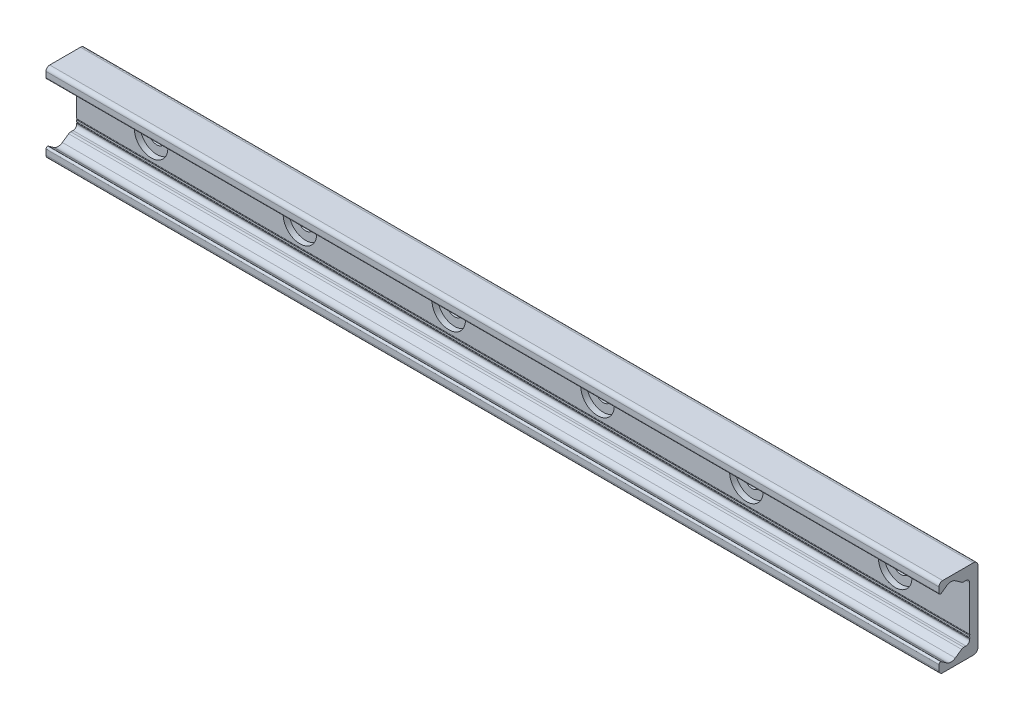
ISO-10303-21;
HEADER;
FILE_DESCRIPTION(('STEP AP214'),'2;1');
FILE_NAME('part.step','',(''),(''),'','','');
FILE_SCHEMA(('AUTOMOTIVE_DESIGN { 1 0 10303 214 1 1 1 1 }'));
ENDSEC;
DATA;
#1=APPLICATION_CONTEXT('core data for automotive mechanical design processes');
#2=APPLICATION_PROTOCOL_DEFINITION('international standard','automotive_design',2000,#1);
#3=PRODUCT_CONTEXT('',#1,'mechanical');
#4=PRODUCT('Part','Part','',(#3));
#5=PRODUCT_RELATED_PRODUCT_CATEGORY('part','',(#4));
#6=PRODUCT_DEFINITION_FORMATION('','',#4);
#7=PRODUCT_DEFINITION_CONTEXT('part definition',#1,'design');
#8=PRODUCT_DEFINITION('design','',#6,#7);
#9=PRODUCT_DEFINITION_SHAPE('','',#8);
#10=(LENGTH_UNIT() NAMED_UNIT(*) SI_UNIT(.MILLI.,.METRE.));
#11=(NAMED_UNIT(*) PLANE_ANGLE_UNIT() SI_UNIT($,.RADIAN.));
#12=(NAMED_UNIT(*) SI_UNIT($,.STERADIAN.) SOLID_ANGLE_UNIT());
#13=UNCERTAINTY_MEASURE_WITH_UNIT(LENGTH_MEASURE(1.E-05),#10,'distance_accuracy_value','');
#14=(GEOMETRIC_REPRESENTATION_CONTEXT(3) GLOBAL_UNCERTAINTY_ASSIGNED_CONTEXT((#13)) GLOBAL_UNIT_ASSIGNED_CONTEXT((#10,
#11,#12)) REPRESENTATION_CONTEXT('',''));
#15=CARTESIAN_POINT('',(0.,0.,0.));
#16=DIRECTION('',(0.,0.,1.));
#17=DIRECTION('',(1.,0.,0.));
#18=AXIS2_PLACEMENT_3D('',#15,#16,#17);
#19=CARTESIAN_POINT('',(-200.,0.,1.39999999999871));
#20=DIRECTION('',(0.,0.,1.));
#21=DIRECTION('',(1.,0.,0.));
#22=AXIS2_PLACEMENT_3D('',#19,#20,#21);
#23=PLANE('',#22);
#24=CARTESIAN_POINT('',(-200.,0.,1.39999999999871));
#25=DIRECTION('',(0.,0.,1.));
#26=DIRECTION('',(1.,0.,0.));
#27=AXIS2_PLACEMENT_3D('',#24,#25,#26);
#28=CIRCLE('',#27,4.49999999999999);
#29=CARTESIAN_POINT('',(-195.5,0.,1.39999999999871));
#30=VERTEX_POINT('',#29);
#31=EDGE_CURVE('E505',#30,#30,#28,.T.);
#32=ORIENTED_EDGE('',*,*,#31,.F.);
#33=EDGE_LOOP('',(#32));
#34=FACE_BOUND('',#33,.T.);
#35=CARTESIAN_POINT('',(-200.,0.,1.39999999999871));
#36=DIRECTION('',(0.,0.,1.));
#37=DIRECTION('',(1.,0.,0.));
#38=AXIS2_PLACEMENT_3D('',#35,#36,#37);
#39=CIRCLE('',#38,9.00000000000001);
#40=CARTESIAN_POINT('',(-191.,0.,1.39999999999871));
#41=VERTEX_POINT('',#40);
#42=EDGE_CURVE('E11',#41,#41,#39,.T.);
#43=ORIENTED_EDGE('',*,*,#42,.T.);
#44=EDGE_LOOP('',(#43));
#45=FACE_BOUND('',#44,.T.);
#46=ADVANCED_FACE('F39',(#34,#45),#23,.T.);
#47=CARTESIAN_POINT('',(-200.,0.,1.39999999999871));
#48=DIRECTION('',(0.,0.,1.));
#49=DIRECTION('',(1.,0.,0.));
#50=AXIS2_PLACEMENT_3D('',#47,#48,#49);
#51=CYLINDRICAL_SURFACE('',#50,9.00000000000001);
#52=CARTESIAN_POINT('',(-200.,0.,4.49999999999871));
#53=DIRECTION('',(0.,0.,1.));
#54=DIRECTION('',(1.,0.,0.));
#55=AXIS2_PLACEMENT_3D('',#52,#53,#54);
#56=CIRCLE('',#55,9.00000000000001);
#57=CARTESIAN_POINT('',(-191.,0.,4.49999999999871));
#58=VERTEX_POINT('',#57);
#59=EDGE_CURVE('E49',#58,#58,#56,.T.);
#60=CARTESIAN_POINT('',(-191.,0.,1.39999999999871));
#61=CARTESIAN_POINT('',(-191.,0.,1.43229166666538));
#62=CARTESIAN_POINT('',(-191.,0.,1.46458333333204));
#63=CARTESIAN_POINT('',(-191.,0.,1.52916666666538));
#64=CARTESIAN_POINT('',(-191.,0.,1.56145833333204));
#65=CARTESIAN_POINT('',(-191.,0.,1.62604166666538));
#66=CARTESIAN_POINT('',(-191.,0.,1.65833333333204));
#67=CARTESIAN_POINT('',(-191.,0.,1.72291666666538));
#68=CARTESIAN_POINT('',(-191.,0.,1.75520833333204));
#69=CARTESIAN_POINT('',(-191.,0.,1.81979166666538));
#70=CARTESIAN_POINT('',(-191.,0.,1.85208333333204));
#71=CARTESIAN_POINT('',(-191.,0.,1.91666666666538));
#72=CARTESIAN_POINT('',(-191.,0.,1.94895833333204));
#73=CARTESIAN_POINT('',(-191.,0.,2.01354166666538));
#74=CARTESIAN_POINT('',(-191.,0.,2.04583333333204));
#75=CARTESIAN_POINT('',(-191.,0.,2.11041666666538));
#76=CARTESIAN_POINT('',(-191.,0.,2.14270833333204));
#77=CARTESIAN_POINT('',(-191.,0.,2.20729166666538));
#78=CARTESIAN_POINT('',(-191.,0.,2.23958333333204));
#79=CARTESIAN_POINT('',(-191.,0.,2.30416666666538));
#80=CARTESIAN_POINT('',(-191.,0.,2.33645833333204));
#81=CARTESIAN_POINT('',(-191.,0.,2.40104166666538));
#82=CARTESIAN_POINT('',(-191.,0.,2.43333333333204));
#83=CARTESIAN_POINT('',(-191.,0.,2.49791666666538));
#84=CARTESIAN_POINT('',(-191.,0.,2.53020833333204));
#85=CARTESIAN_POINT('',(-191.,0.,2.59479166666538));
#86=CARTESIAN_POINT('',(-191.,0.,2.62708333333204));
#87=CARTESIAN_POINT('',(-191.,0.,2.69166666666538));
#88=CARTESIAN_POINT('',(-191.,0.,2.72395833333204));
#89=CARTESIAN_POINT('',(-191.,0.,2.78854166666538));
#90=CARTESIAN_POINT('',(-191.,0.,2.82083333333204));
#91=CARTESIAN_POINT('',(-191.,0.,2.88541666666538));
#92=CARTESIAN_POINT('',(-191.,0.,2.91770833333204));
#93=CARTESIAN_POINT('',(-191.,0.,2.98229166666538));
#94=CARTESIAN_POINT('',(-191.,0.,3.01458333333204));
#95=CARTESIAN_POINT('',(-191.,0.,3.07916666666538));
#96=CARTESIAN_POINT('',(-191.,0.,3.11145833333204));
#97=CARTESIAN_POINT('',(-191.,0.,3.17604166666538));
#98=CARTESIAN_POINT('',(-191.,0.,3.20833333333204));
#99=CARTESIAN_POINT('',(-191.,0.,3.27291666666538));
#100=CARTESIAN_POINT('',(-191.,0.,3.30520833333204));
#101=CARTESIAN_POINT('',(-191.,0.,3.36979166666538));
#102=CARTESIAN_POINT('',(-191.,0.,3.40208333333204));
#103=CARTESIAN_POINT('',(-191.,0.,3.46666666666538));
#104=CARTESIAN_POINT('',(-191.,0.,3.49895833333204));
#105=CARTESIAN_POINT('',(-191.,0.,3.56354166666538));
#106=CARTESIAN_POINT('',(-191.,0.,3.59583333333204));
#107=CARTESIAN_POINT('',(-191.,0.,3.66041666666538));
#108=CARTESIAN_POINT('',(-191.,0.,3.69270833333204));
#109=CARTESIAN_POINT('',(-191.,0.,3.75729166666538));
#110=CARTESIAN_POINT('',(-191.,0.,3.78958333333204));
#111=CARTESIAN_POINT('',(-191.,0.,3.85416666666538));
#112=CARTESIAN_POINT('',(-191.,0.,3.88645833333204));
#113=CARTESIAN_POINT('',(-191.,0.,3.95104166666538));
#114=CARTESIAN_POINT('',(-191.,0.,3.98333333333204));
#115=CARTESIAN_POINT('',(-191.,0.,4.04791666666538));
#116=CARTESIAN_POINT('',(-191.,0.,4.08020833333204));
#117=CARTESIAN_POINT('',(-191.,0.,4.14479166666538));
#118=CARTESIAN_POINT('',(-191.,0.,4.17708333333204));
#119=CARTESIAN_POINT('',(-191.,0.,4.24166666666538));
#120=CARTESIAN_POINT('',(-191.,0.,4.27395833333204));
#121=CARTESIAN_POINT('',(-191.,0.,4.33854166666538));
#122=CARTESIAN_POINT('',(-191.,0.,4.37083333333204));
#123=CARTESIAN_POINT('',(-191.,0.,4.43541666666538));
#124=CARTESIAN_POINT('',(-191.,0.,4.46770833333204));
#125=CARTESIAN_POINT('',(-191.,0.,4.49999999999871));
#126=B_SPLINE_CURVE_WITH_KNOTS('',3,(#60,#61,#62,#63,#64,#65,#66,#67,#68,#69,#70,#71,#72,#73,
#74,#75,#76,#77,#78,#79,#80,#81,#82,#83,#84,#85,#86,#87,#88,#89,#90,#91,#92,#93,#94,#95,#96,#97,
#98,#99,#100,#101,#102,#103,#104,#105,#106,#107,#108,#109,#110,#111,#112,#113,#114,#115,#116,
#117,#118,#119,#120,#121,#122,#123,#124,#125),.UNSPECIFIED.,.F.,.F.,(4,2,2,2,2,2,2,2,2,2,2,2,2,
2,2,2,2,2,2,2,2,2,2,2,2,2,2,2,2,2,2,2,4),(0.,0.0968750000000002,0.19375,0.290625,0.3875,
0.484375,0.58125,0.678125,0.775,0.871875,0.96875,1.065625,1.1625,1.259375,1.35625,1.453125,1.55,
1.646875,1.74375,1.840625,1.9375,2.034375,2.13125,2.228125,2.325,2.421875,2.51875,2.615625,
2.7125,2.809375,2.90625,3.003125,3.1),.UNSPECIFIED.);
#127=EDGE_CURVE('BSEAM475',#41,#58,#126,.T.);
#128=ORIENTED_EDGE('',*,*,#42,.F.);
#129=ORIENTED_EDGE('',*,*,#59,.T.);
#130=ORIENTED_EDGE('',*,*,#127,.T.);
#131=ORIENTED_EDGE('',*,*,#127,.F.);
#132=EDGE_LOOP('',(#128,#130,#129,#131));
#133=FACE_BOUND('',#132,.T.);
#134=ADVANCED_FACE('F475',(#133),#51,.F.);
#135=CARTESIAN_POINT('',(-120.,0.,1.39999999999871));
#136=DIRECTION('',(0.,0.,1.));
#137=DIRECTION('',(1.,0.,0.));
#138=AXIS2_PLACEMENT_3D('',#135,#136,#137);
#139=PLANE('',#138);
#140=CARTESIAN_POINT('',(-120.,0.,1.39999999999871));
#141=DIRECTION('',(0.,0.,1.));
#142=DIRECTION('',(1.,0.,0.));
#143=AXIS2_PLACEMENT_3D('',#140,#141,#142);
#144=CIRCLE('',#143,4.49999999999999);
#145=CARTESIAN_POINT('',(-115.5,0.,1.39999999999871));
#146=VERTEX_POINT('',#145);
#147=EDGE_CURVE('E509',#146,#146,#144,.T.);
#148=ORIENTED_EDGE('',*,*,#147,.F.);
#149=EDGE_LOOP('',(#148));
#150=FACE_BOUND('',#149,.T.);
#151=CARTESIAN_POINT('',(-120.,0.,1.39999999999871));
#152=DIRECTION('',(0.,0.,1.));
#153=DIRECTION('',(1.,0.,0.));
#154=AXIS2_PLACEMENT_3D('',#151,#152,#153);
#155=CIRCLE('',#154,9.00000000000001);
#156=CARTESIAN_POINT('',(-111.,0.,1.39999999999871));
#157=VERTEX_POINT('',#156);
#158=EDGE_CURVE('E467',#157,#157,#155,.T.);
#159=ORIENTED_EDGE('',*,*,#158,.T.);
#160=EDGE_LOOP('',(#159));
#161=FACE_BOUND('',#160,.T.);
#162=ADVANCED_FACE('F500',(#150,#161),#139,.T.);
#163=CARTESIAN_POINT('',(-120.,0.,1.39999999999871));
#164=DIRECTION('',(0.,0.,1.));
#165=DIRECTION('',(1.,0.,0.));
#166=AXIS2_PLACEMENT_3D('',#163,#164,#165);
#167=CYLINDRICAL_SURFACE('',#166,9.00000000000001);
#168=CARTESIAN_POINT('',(-120.,0.,4.49999999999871));
#169=DIRECTION('',(0.,0.,1.));
#170=DIRECTION('',(1.,0.,0.));
#171=AXIS2_PLACEMENT_3D('',#168,#169,#170);
#172=CIRCLE('',#171,9.00000000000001);
#173=CARTESIAN_POINT('',(-111.,0.,4.49999999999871));
#174=VERTEX_POINT('',#173);
#175=EDGE_CURVE('E463',#174,#174,#172,.T.);
#176=CARTESIAN_POINT('',(-111.,0.,1.39999999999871));
#177=CARTESIAN_POINT('',(-111.,0.,1.43229166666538));
#178=CARTESIAN_POINT('',(-111.,0.,1.46458333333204));
#179=CARTESIAN_POINT('',(-111.,0.,1.52916666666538));
#180=CARTESIAN_POINT('',(-111.,0.,1.56145833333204));
#181=CARTESIAN_POINT('',(-111.,0.,1.62604166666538));
#182=CARTESIAN_POINT('',(-111.,0.,1.65833333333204));
#183=CARTESIAN_POINT('',(-111.,0.,1.72291666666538));
#184=CARTESIAN_POINT('',(-111.,0.,1.75520833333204));
#185=CARTESIAN_POINT('',(-111.,0.,1.81979166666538));
#186=CARTESIAN_POINT('',(-111.,0.,1.85208333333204));
#187=CARTESIAN_POINT('',(-111.,0.,1.91666666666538));
#188=CARTESIAN_POINT('',(-111.,0.,1.94895833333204));
#189=CARTESIAN_POINT('',(-111.,0.,2.01354166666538));
#190=CARTESIAN_POINT('',(-111.,0.,2.04583333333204));
#191=CARTESIAN_POINT('',(-111.,0.,2.11041666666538));
#192=CARTESIAN_POINT('',(-111.,0.,2.14270833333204));
#193=CARTESIAN_POINT('',(-111.,0.,2.20729166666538));
#194=CARTESIAN_POINT('',(-111.,0.,2.23958333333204));
#195=CARTESIAN_POINT('',(-111.,0.,2.30416666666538));
#196=CARTESIAN_POINT('',(-111.,0.,2.33645833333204));
#197=CARTESIAN_POINT('',(-111.,0.,2.40104166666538));
#198=CARTESIAN_POINT('',(-111.,0.,2.43333333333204));
#199=CARTESIAN_POINT('',(-111.,0.,2.49791666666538));
#200=CARTESIAN_POINT('',(-111.,0.,2.53020833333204));
#201=CARTESIAN_POINT('',(-111.,0.,2.59479166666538));
#202=CARTESIAN_POINT('',(-111.,0.,2.62708333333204));
#203=CARTESIAN_POINT('',(-111.,0.,2.69166666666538));
#204=CARTESIAN_POINT('',(-111.,0.,2.72395833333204));
#205=CARTESIAN_POINT('',(-111.,0.,2.78854166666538));
#206=CARTESIAN_POINT('',(-111.,0.,2.82083333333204));
#207=CARTESIAN_POINT('',(-111.,0.,2.88541666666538));
#208=CARTESIAN_POINT('',(-111.,0.,2.91770833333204));
#209=CARTESIAN_POINT('',(-111.,0.,2.98229166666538));
#210=CARTESIAN_POINT('',(-111.,0.,3.01458333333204));
#211=CARTESIAN_POINT('',(-111.,0.,3.07916666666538));
#212=CARTESIAN_POINT('',(-111.,0.,3.11145833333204));
#213=CARTESIAN_POINT('',(-111.,0.,3.17604166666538));
#214=CARTESIAN_POINT('',(-111.,0.,3.20833333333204));
#215=CARTESIAN_POINT('',(-111.,0.,3.27291666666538));
#216=CARTESIAN_POINT('',(-111.,0.,3.30520833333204));
#217=CARTESIAN_POINT('',(-111.,0.,3.36979166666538));
#218=CARTESIAN_POINT('',(-111.,0.,3.40208333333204));
#219=CARTESIAN_POINT('',(-111.,0.,3.46666666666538));
#220=CARTESIAN_POINT('',(-111.,0.,3.49895833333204));
#221=CARTESIAN_POINT('',(-111.,0.,3.56354166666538));
#222=CARTESIAN_POINT('',(-111.,0.,3.59583333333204));
#223=CARTESIAN_POINT('',(-111.,0.,3.66041666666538));
#224=CARTESIAN_POINT('',(-111.,0.,3.69270833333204));
#225=CARTESIAN_POINT('',(-111.,0.,3.75729166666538));
#226=CARTESIAN_POINT('',(-111.,0.,3.78958333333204));
#227=CARTESIAN_POINT('',(-111.,0.,3.85416666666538));
#228=CARTESIAN_POINT('',(-111.,0.,3.88645833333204));
#229=CARTESIAN_POINT('',(-111.,0.,3.95104166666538));
#230=CARTESIAN_POINT('',(-111.,0.,3.98333333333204));
#231=CARTESIAN_POINT('',(-111.,0.,4.04791666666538));
#232=CARTESIAN_POINT('',(-111.,0.,4.08020833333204));
#233=CARTESIAN_POINT('',(-111.,0.,4.14479166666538));
#234=CARTESIAN_POINT('',(-111.,0.,4.17708333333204));
#235=CARTESIAN_POINT('',(-111.,0.,4.24166666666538));
#236=CARTESIAN_POINT('',(-111.,0.,4.27395833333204));
#237=CARTESIAN_POINT('',(-111.,0.,4.33854166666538));
#238=CARTESIAN_POINT('',(-111.,0.,4.37083333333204));
#239=CARTESIAN_POINT('',(-111.,0.,4.43541666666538));
#240=CARTESIAN_POINT('',(-111.,0.,4.46770833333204));
#241=CARTESIAN_POINT('',(-111.,0.,4.49999999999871));
#242=B_SPLINE_CURVE_WITH_KNOTS('',3,(#176,#177,#178,#179,#180,#181,#182,#183,#184,#185,#186,
#187,#188,#189,#190,#191,#192,#193,#194,#195,#196,#197,#198,#199,#200,#201,#202,#203,#204,#205,
#206,#207,#208,#209,#210,#211,#212,#213,#214,#215,#216,#217,#218,#219,#220,#221,#222,#223,#224,
#225,#226,#227,#228,#229,#230,#231,#232,#233,#234,#235,#236,#237,#238,#239,#240,#241),
.UNSPECIFIED.,.F.,.F.,(4,2,2,2,2,2,2,2,2,2,2,2,2,2,2,2,2,2,2,2,2,2,2,2,2,2,2,2,2,2,2,2,4),(0.,
0.0968750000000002,0.19375,0.290625,0.3875,0.484375,0.58125,0.678125,0.775,0.871875,0.96875,
1.065625,1.1625,1.259375,1.35625,1.453125,1.55,1.646875,1.74375,1.840625,1.9375,2.034375,
2.13125,2.228125,2.325,2.421875,2.51875,2.615625,2.7125,2.809375,2.90625,3.003125,3.1),.UNSPECIFIED.);
#243=EDGE_CURVE('BSEAM855',#157,#174,#242,.T.);
#244=ORIENTED_EDGE('',*,*,#158,.F.);
#245=ORIENTED_EDGE('',*,*,#175,.T.);
#246=ORIENTED_EDGE('',*,*,#243,.T.);
#247=ORIENTED_EDGE('',*,*,#243,.F.);
#248=EDGE_LOOP('',(#244,#246,#245,#247));
#249=FACE_BOUND('',#248,.T.);
#250=ADVANCED_FACE('F855',(#249),#167,.F.);
#251=CARTESIAN_POINT('',(-40.,0.,1.39999999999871));
#252=DIRECTION('',(0.,0.,1.));
#253=DIRECTION('',(1.,0.,0.));
#254=AXIS2_PLACEMENT_3D('',#251,#252,#253);
#255=PLANE('',#254);
#256=CARTESIAN_POINT('',(-40.,0.,1.39999999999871));
#257=DIRECTION('',(0.,0.,1.));
#258=DIRECTION('',(1.,0.,0.));
#259=AXIS2_PLACEMENT_3D('',#256,#257,#258);
#260=CIRCLE('',#259,4.49999999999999);
#261=CARTESIAN_POINT('',(-35.5,0.,1.39999999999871));
#262=VERTEX_POINT('',#261);
#263=EDGE_CURVE('E514',#262,#262,#260,.T.);
#264=ORIENTED_EDGE('',*,*,#263,.F.);
#265=EDGE_LOOP('',(#264));
#266=FACE_BOUND('',#265,.T.);
#267=CARTESIAN_POINT('',(-40.,0.,1.39999999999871));
#268=DIRECTION('',(0.,0.,1.));
#269=DIRECTION('',(1.,0.,0.));
#270=AXIS2_PLACEMENT_3D('',#267,#268,#269);
#271=CIRCLE('',#270,9.00000000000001);
#272=CARTESIAN_POINT('',(-31.,0.,1.39999999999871));
#273=VERTEX_POINT('',#272);
#274=EDGE_CURVE('E459',#273,#273,#271,.T.);
#275=ORIENTED_EDGE('',*,*,#274,.T.);
#276=EDGE_LOOP('',(#275));
#277=FACE_BOUND('',#276,.T.);
#278=ADVANCED_FACE('F851',(#266,#277),#255,.T.);
#279=CARTESIAN_POINT('',(-40.,0.,1.39999999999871));
#280=DIRECTION('',(0.,0.,1.));
#281=DIRECTION('',(1.,0.,0.));
#282=AXIS2_PLACEMENT_3D('',#279,#280,#281);
#283=CYLINDRICAL_SURFACE('',#282,9.00000000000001);
#284=CARTESIAN_POINT('',(-40.,0.,4.49999999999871));
#285=DIRECTION('',(0.,0.,1.));
#286=DIRECTION('',(1.,0.,0.));
#287=AXIS2_PLACEMENT_3D('',#284,#285,#286);
#288=CIRCLE('',#287,9.00000000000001);
#289=CARTESIAN_POINT('',(-31.,0.,4.49999999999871));
#290=VERTEX_POINT('',#289);
#291=EDGE_CURVE('E455',#290,#290,#288,.T.);
#292=CARTESIAN_POINT('',(-31.,0.,1.39999999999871));
#293=CARTESIAN_POINT('',(-31.,0.,1.43229166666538));
#294=CARTESIAN_POINT('',(-31.,0.,1.46458333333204));
#295=CARTESIAN_POINT('',(-31.,0.,1.52916666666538));
#296=CARTESIAN_POINT('',(-31.,0.,1.56145833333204));
#297=CARTESIAN_POINT('',(-31.,0.,1.62604166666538));
#298=CARTESIAN_POINT('',(-31.,0.,1.65833333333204));
#299=CARTESIAN_POINT('',(-31.,0.,1.72291666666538));
#300=CARTESIAN_POINT('',(-31.,0.,1.75520833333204));
#301=CARTESIAN_POINT('',(-31.,0.,1.81979166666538));
#302=CARTESIAN_POINT('',(-31.,0.,1.85208333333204));
#303=CARTESIAN_POINT('',(-31.,0.,1.91666666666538));
#304=CARTESIAN_POINT('',(-31.,0.,1.94895833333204));
#305=CARTESIAN_POINT('',(-31.,0.,2.01354166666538));
#306=CARTESIAN_POINT('',(-31.,0.,2.04583333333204));
#307=CARTESIAN_POINT('',(-31.,0.,2.11041666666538));
#308=CARTESIAN_POINT('',(-31.,0.,2.14270833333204));
#309=CARTESIAN_POINT('',(-31.,0.,2.20729166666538));
#310=CARTESIAN_POINT('',(-31.,0.,2.23958333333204));
#311=CARTESIAN_POINT('',(-31.,0.,2.30416666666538));
#312=CARTESIAN_POINT('',(-31.,0.,2.33645833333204));
#313=CARTESIAN_POINT('',(-31.,0.,2.40104166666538));
#314=CARTESIAN_POINT('',(-31.,0.,2.43333333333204));
#315=CARTESIAN_POINT('',(-31.,0.,2.49791666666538));
#316=CARTESIAN_POINT('',(-31.,0.,2.53020833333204));
#317=CARTESIAN_POINT('',(-31.,0.,2.59479166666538));
#318=CARTESIAN_POINT('',(-31.,0.,2.62708333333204));
#319=CARTESIAN_POINT('',(-31.,0.,2.69166666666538));
#320=CARTESIAN_POINT('',(-31.,0.,2.72395833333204));
#321=CARTESIAN_POINT('',(-31.,0.,2.78854166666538));
#322=CARTESIAN_POINT('',(-31.,0.,2.82083333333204));
#323=CARTESIAN_POINT('',(-31.,0.,2.88541666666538));
#324=CARTESIAN_POINT('',(-31.,0.,2.91770833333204));
#325=CARTESIAN_POINT('',(-31.,0.,2.98229166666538));
#326=CARTESIAN_POINT('',(-31.,0.,3.01458333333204));
#327=CARTESIAN_POINT('',(-31.,0.,3.07916666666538));
#328=CARTESIAN_POINT('',(-31.,0.,3.11145833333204));
#329=CARTESIAN_POINT('',(-31.,0.,3.17604166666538));
#330=CARTESIAN_POINT('',(-31.,0.,3.20833333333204));
#331=CARTESIAN_POINT('',(-31.,0.,3.27291666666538));
#332=CARTESIAN_POINT('',(-31.,0.,3.30520833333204));
#333=CARTESIAN_POINT('',(-31.,0.,3.36979166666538));
#334=CARTESIAN_POINT('',(-31.,0.,3.40208333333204));
#335=CARTESIAN_POINT('',(-31.,0.,3.46666666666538));
#336=CARTESIAN_POINT('',(-31.,0.,3.49895833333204));
#337=CARTESIAN_POINT('',(-31.,0.,3.56354166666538));
#338=CARTESIAN_POINT('',(-31.,0.,3.59583333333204));
#339=CARTESIAN_POINT('',(-31.,0.,3.66041666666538));
#340=CARTESIAN_POINT('',(-31.,0.,3.69270833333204));
#341=CARTESIAN_POINT('',(-31.,0.,3.75729166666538));
#342=CARTESIAN_POINT('',(-31.,0.,3.78958333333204));
#343=CARTESIAN_POINT('',(-31.,0.,3.85416666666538));
#344=CARTESIAN_POINT('',(-31.,0.,3.88645833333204));
#345=CARTESIAN_POINT('',(-31.,0.,3.95104166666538));
#346=CARTESIAN_POINT('',(-31.,0.,3.98333333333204));
#347=CARTESIAN_POINT('',(-31.,0.,4.04791666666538));
#348=CARTESIAN_POINT('',(-31.,0.,4.08020833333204));
#349=CARTESIAN_POINT('',(-31.,0.,4.14479166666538));
#350=CARTESIAN_POINT('',(-31.,0.,4.17708333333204));
#351=CARTESIAN_POINT('',(-31.,0.,4.24166666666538));
#352=CARTESIAN_POINT('',(-31.,0.,4.27395833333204));
#353=CARTESIAN_POINT('',(-31.,0.,4.33854166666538));
#354=CARTESIAN_POINT('',(-31.,0.,4.37083333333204));
#355=CARTESIAN_POINT('',(-31.,0.,4.43541666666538));
#356=CARTESIAN_POINT('',(-31.,0.,4.46770833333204));
#357=CARTESIAN_POINT('',(-31.,0.,4.49999999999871));
#358=B_SPLINE_CURVE_WITH_KNOTS('',3,(#292,#293,#294,#295,#296,#297,#298,#299,#300,#301,#302,
#303,#304,#305,#306,#307,#308,#309,#310,#311,#312,#313,#314,#315,#316,#317,#318,#319,#320,#321,
#322,#323,#324,#325,#326,#327,#328,#329,#330,#331,#332,#333,#334,#335,#336,#337,#338,#339,#340,
#341,#342,#343,#344,#345,#346,#347,#348,#349,#350,#351,#352,#353,#354,#355,#356,#357),
.UNSPECIFIED.,.F.,.F.,(4,2,2,2,2,2,2,2,2,2,2,2,2,2,2,2,2,2,2,2,2,2,2,2,2,2,2,2,2,2,2,2,4),(0.,
0.0968750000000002,0.19375,0.290625,0.3875,0.484375,0.58125,0.678125,0.775,0.871875,0.96875,
1.065625,1.1625,1.259375,1.35625,1.453125,1.55,1.646875,1.74375,1.840625,1.9375,2.034375,
2.13125,2.228125,2.325,2.421875,2.51875,2.615625,2.7125,2.809375,2.90625,3.003125,3.1),.UNSPECIFIED.);
#359=EDGE_CURVE('BSEAM847',#273,#290,#358,.T.);
#360=ORIENTED_EDGE('',*,*,#274,.F.);
#361=ORIENTED_EDGE('',*,*,#291,.T.);
#362=ORIENTED_EDGE('',*,*,#359,.T.);
#363=ORIENTED_EDGE('',*,*,#359,.F.);
#364=EDGE_LOOP('',(#360,#362,#361,#363));
#365=FACE_BOUND('',#364,.T.);
#366=ADVANCED_FACE('F847',(#365),#283,.F.);
#367=CARTESIAN_POINT('',(40.,0.,1.39999999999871));
#368=DIRECTION('',(0.,0.,1.));
#369=DIRECTION('',(1.,0.,0.));
#370=AXIS2_PLACEMENT_3D('',#367,#368,#369);
#371=PLANE('',#370);
#372=CARTESIAN_POINT('',(40.,0.,1.39999999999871));
#373=DIRECTION('',(0.,0.,1.));
#374=DIRECTION('',(1.,0.,0.));
#375=AXIS2_PLACEMENT_3D('',#372,#373,#374);
#376=CIRCLE('',#375,4.49999999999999);
#377=CARTESIAN_POINT('',(44.5,0.,1.39999999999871));
#378=VERTEX_POINT('',#377);
#379=EDGE_CURVE('E524',#378,#378,#376,.T.);
#380=ORIENTED_EDGE('',*,*,#379,.F.);
#381=EDGE_LOOP('',(#380));
#382=FACE_BOUND('',#381,.T.);
#383=CARTESIAN_POINT('',(40.,0.,1.39999999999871));
#384=DIRECTION('',(0.,0.,1.));
#385=DIRECTION('',(1.,0.,0.));
#386=AXIS2_PLACEMENT_3D('',#383,#384,#385);
#387=CIRCLE('',#386,9.00000000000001);
#388=CARTESIAN_POINT('',(49.,0.,1.39999999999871));
#389=VERTEX_POINT('',#388);
#390=EDGE_CURVE('E451',#389,#389,#387,.T.);
#391=ORIENTED_EDGE('',*,*,#390,.T.);
#392=EDGE_LOOP('',(#391));
#393=FACE_BOUND('',#392,.T.);
#394=ADVANCED_FACE('F840',(#382,#393),#371,.T.);
#395=CARTESIAN_POINT('',(40.,0.,1.39999999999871));
#396=DIRECTION('',(0.,0.,1.));
#397=DIRECTION('',(1.,0.,0.));
#398=AXIS2_PLACEMENT_3D('',#395,#396,#397);
#399=CYLINDRICAL_SURFACE('',#398,9.00000000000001);
#400=CARTESIAN_POINT('',(40.,0.,4.49999999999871));
#401=DIRECTION('',(0.,0.,1.));
#402=DIRECTION('',(1.,0.,0.));
#403=AXIS2_PLACEMENT_3D('',#400,#401,#402);
#404=CIRCLE('',#403,9.00000000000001);
#405=CARTESIAN_POINT('',(49.,0.,4.49999999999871));
#406=VERTEX_POINT('',#405);
#407=EDGE_CURVE('E447',#406,#406,#404,.T.);
#408=CARTESIAN_POINT('',(49.,0.,1.39999999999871));
#409=CARTESIAN_POINT('',(49.,0.,1.43229166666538));
#410=CARTESIAN_POINT('',(49.,0.,1.46458333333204));
#411=CARTESIAN_POINT('',(49.,0.,1.52916666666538));
#412=CARTESIAN_POINT('',(49.,0.,1.56145833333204));
#413=CARTESIAN_POINT('',(49.,0.,1.62604166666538));
#414=CARTESIAN_POINT('',(49.,0.,1.65833333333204));
#415=CARTESIAN_POINT('',(49.,0.,1.72291666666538));
#416=CARTESIAN_POINT('',(49.,0.,1.75520833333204));
#417=CARTESIAN_POINT('',(49.,0.,1.81979166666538));
#418=CARTESIAN_POINT('',(49.,0.,1.85208333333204));
#419=CARTESIAN_POINT('',(49.,0.,1.91666666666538));
#420=CARTESIAN_POINT('',(49.,0.,1.94895833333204));
#421=CARTESIAN_POINT('',(49.,0.,2.01354166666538));
#422=CARTESIAN_POINT('',(49.,0.,2.04583333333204));
#423=CARTESIAN_POINT('',(49.,0.,2.11041666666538));
#424=CARTESIAN_POINT('',(49.,0.,2.14270833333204));
#425=CARTESIAN_POINT('',(49.,0.,2.20729166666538));
#426=CARTESIAN_POINT('',(49.,0.,2.23958333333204));
#427=CARTESIAN_POINT('',(49.,0.,2.30416666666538));
#428=CARTESIAN_POINT('',(49.,0.,2.33645833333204));
#429=CARTESIAN_POINT('',(49.,0.,2.40104166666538));
#430=CARTESIAN_POINT('',(49.,0.,2.43333333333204));
#431=CARTESIAN_POINT('',(49.,0.,2.49791666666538));
#432=CARTESIAN_POINT('',(49.,0.,2.53020833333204));
#433=CARTESIAN_POINT('',(49.,0.,2.59479166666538));
#434=CARTESIAN_POINT('',(49.,0.,2.62708333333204));
#435=CARTESIAN_POINT('',(49.,0.,2.69166666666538));
#436=CARTESIAN_POINT('',(49.,0.,2.72395833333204));
#437=CARTESIAN_POINT('',(49.,0.,2.78854166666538));
#438=CARTESIAN_POINT('',(49.,0.,2.82083333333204));
#439=CARTESIAN_POINT('',(49.,0.,2.88541666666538));
#440=CARTESIAN_POINT('',(49.,0.,2.91770833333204));
#441=CARTESIAN_POINT('',(49.,0.,2.98229166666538));
#442=CARTESIAN_POINT('',(49.,0.,3.01458333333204));
#443=CARTESIAN_POINT('',(49.,0.,3.07916666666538));
#444=CARTESIAN_POINT('',(49.,0.,3.11145833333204));
#445=CARTESIAN_POINT('',(49.,0.,3.17604166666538));
#446=CARTESIAN_POINT('',(49.,0.,3.20833333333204));
#447=CARTESIAN_POINT('',(49.,0.,3.27291666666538));
#448=CARTESIAN_POINT('',(49.,0.,3.30520833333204));
#449=CARTESIAN_POINT('',(49.,0.,3.36979166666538));
#450=CARTESIAN_POINT('',(49.,0.,3.40208333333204));
#451=CARTESIAN_POINT('',(49.,0.,3.46666666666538));
#452=CARTESIAN_POINT('',(49.,0.,3.49895833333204));
#453=CARTESIAN_POINT('',(49.,0.,3.56354166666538));
#454=CARTESIAN_POINT('',(49.,0.,3.59583333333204));
#455=CARTESIAN_POINT('',(49.,0.,3.66041666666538));
#456=CARTESIAN_POINT('',(49.,0.,3.69270833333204));
#457=CARTESIAN_POINT('',(49.,0.,3.75729166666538));
#458=CARTESIAN_POINT('',(49.,0.,3.78958333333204));
#459=CARTESIAN_POINT('',(49.,0.,3.85416666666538));
#460=CARTESIAN_POINT('',(49.,0.,3.88645833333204));
#461=CARTESIAN_POINT('',(49.,0.,3.95104166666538));
#462=CARTESIAN_POINT('',(49.,0.,3.98333333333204));
#463=CARTESIAN_POINT('',(49.,0.,4.04791666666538));
#464=CARTESIAN_POINT('',(49.,0.,4.08020833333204));
#465=CARTESIAN_POINT('',(49.,0.,4.14479166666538));
#466=CARTESIAN_POINT('',(49.,0.,4.17708333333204));
#467=CARTESIAN_POINT('',(49.,0.,4.24166666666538));
#468=CARTESIAN_POINT('',(49.,0.,4.27395833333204));
#469=CARTESIAN_POINT('',(49.,0.,4.33854166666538));
#470=CARTESIAN_POINT('',(49.,0.,4.37083333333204));
#471=CARTESIAN_POINT('',(49.,0.,4.43541666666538));
#472=CARTESIAN_POINT('',(49.,0.,4.46770833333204));
#473=CARTESIAN_POINT('',(49.,0.,4.49999999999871));
#474=B_SPLINE_CURVE_WITH_KNOTS('',3,(#408,#409,#410,#411,#412,#413,#414,#415,#416,#417,#418,
#419,#420,#421,#422,#423,#424,#425,#426,#427,#428,#429,#430,#431,#432,#433,#434,#435,#436,#437,
#438,#439,#440,#441,#442,#443,#444,#445,#446,#447,#448,#449,#450,#451,#452,#453,#454,#455,#456,
#457,#458,#459,#460,#461,#462,#463,#464,#465,#466,#467,#468,#469,#470,#471,#472,#473),
.UNSPECIFIED.,.F.,.F.,(4,2,2,2,2,2,2,2,2,2,2,2,2,2,2,2,2,2,2,2,2,2,2,2,2,2,2,2,2,2,2,2,4),(0.,
0.0968750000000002,0.19375,0.290625,0.3875,0.484375,0.58125,0.678125,0.775,0.871875,0.96875,
1.065625,1.1625,1.259375,1.35625,1.453125,1.55,1.646875,1.74375,1.840625,1.9375,2.034375,
2.13125,2.228125,2.325,2.421875,2.51875,2.615625,2.7125,2.809375,2.90625,3.003125,3.1),.UNSPECIFIED.);
#475=EDGE_CURVE('BSEAM832',#389,#406,#474,.T.);
#476=ORIENTED_EDGE('',*,*,#390,.F.);
#477=ORIENTED_EDGE('',*,*,#407,.T.);
#478=ORIENTED_EDGE('',*,*,#475,.T.);
#479=ORIENTED_EDGE('',*,*,#475,.F.);
#480=EDGE_LOOP('',(#476,#478,#477,#479));
#481=FACE_BOUND('',#480,.T.);
#482=ADVANCED_FACE('F832',(#481),#399,.F.);
#483=CARTESIAN_POINT('',(240.,0.,0.));
#484=DIRECTION('',(0.,0.,1.));
#485=DIRECTION('',(1.,0.,0.));
#486=AXIS2_PLACEMENT_3D('',#483,#484,#485);
#487=PLANE('',#486);
#488=CARTESIAN_POINT('',(120.,0.,0.));
#489=DIRECTION('',(0.,0.,1.));
#490=DIRECTION('',(1.,0.,0.));
#491=AXIS2_PLACEMENT_3D('',#488,#489,#490);
#492=CIRCLE('',#491,4.49999999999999);
#493=CARTESIAN_POINT('',(124.5,0.,0.));
#494=VERTEX_POINT('',#493);
#495=EDGE_CURVE('E517',#494,#494,#492,.T.);
#496=ORIENTED_EDGE('',*,*,#495,.T.);
#497=EDGE_LOOP('',(#496));
#498=FACE_BOUND('',#497,.T.);
#499=CARTESIAN_POINT('',(40.,0.,0.));
#500=DIRECTION('',(0.,0.,1.));
#501=DIRECTION('',(1.,0.,0.));
#502=AXIS2_PLACEMENT_3D('',#499,#500,#501);
#503=CIRCLE('',#502,4.49999999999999);
#504=CARTESIAN_POINT('',(44.5,0.,0.));
#505=VERTEX_POINT('',#504);
#506=EDGE_CURVE('E623',#505,#505,#503,.T.);
#507=ORIENTED_EDGE('',*,*,#506,.T.);
#508=EDGE_LOOP('',(#507));
#509=FACE_BOUND('',#508,.T.);
#510=CARTESIAN_POINT('',(-40.,0.,0.));
#511=DIRECTION('',(0.,0.,1.));
#512=DIRECTION('',(1.,0.,0.));
#513=AXIS2_PLACEMENT_3D('',#510,#511,#512);
#514=CIRCLE('',#513,4.49999999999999);
#515=CARTESIAN_POINT('',(-35.5,0.,0.));
#516=VERTEX_POINT('',#515);
#517=EDGE_CURVE('E625',#516,#516,#514,.T.);
#518=ORIENTED_EDGE('',*,*,#517,.T.);
#519=EDGE_LOOP('',(#518));
#520=FACE_BOUND('',#519,.T.);
#521=CARTESIAN_POINT('',(-120.,0.,0.));
#522=DIRECTION('',(0.,0.,1.));
#523=DIRECTION('',(1.,0.,0.));
#524=AXIS2_PLACEMENT_3D('',#521,#522,#523);
#525=CIRCLE('',#524,4.49999999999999);
#526=CARTESIAN_POINT('',(-115.5,0.,0.));
#527=VERTEX_POINT('',#526);
#528=EDGE_CURVE('E634',#527,#527,#525,.T.);
#529=ORIENTED_EDGE('',*,*,#528,.T.);
#530=EDGE_LOOP('',(#529));
#531=FACE_BOUND('',#530,.T.);
#532=CARTESIAN_POINT('',(-200.,0.,0.));
#533=DIRECTION('',(0.,0.,1.));
#534=DIRECTION('',(1.,0.,0.));
#535=AXIS2_PLACEMENT_3D('',#532,#533,#534);
#536=CIRCLE('',#535,4.49999999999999);
#537=CARTESIAN_POINT('',(-195.5,0.,0.));
#538=VERTEX_POINT('',#537);
#539=EDGE_CURVE('E519',#538,#538,#536,.T.);
#540=ORIENTED_EDGE('',*,*,#539,.T.);
#541=EDGE_LOOP('',(#540));
#542=FACE_BOUND('',#541,.T.);
#543=CARTESIAN_POINT('',(200.,0.,0.));
#544=DIRECTION('',(0.,0.,1.));
#545=DIRECTION('',(1.,0.,0.));
#546=AXIS2_PLACEMENT_3D('',#543,#544,#545);
#547=CIRCLE('',#546,4.49999999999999);
#548=CARTESIAN_POINT('',(204.5,0.,0.));
#549=VERTEX_POINT('',#548);
#550=EDGE_CURVE('E536',#549,#549,#547,.T.);
#551=ORIENTED_EDGE('',*,*,#550,.T.);
#552=EDGE_LOOP('',(#551));
#553=FACE_BOUND('',#552,.T.);
#554=DIRECTION('',(0.,1.,0.));
#555=VECTOR('',#554,1.);
#556=CARTESIAN_POINT('',(-240.,0.,0.));
#557=LINE('',#556,#555);
#558=CARTESIAN_POINT('',(-240.,-19.,0.));
#559=VERTEX_POINT('',#558);
#560=CARTESIAN_POINT('',(-240.,19.,0.));
#561=VERTEX_POINT('',#560);
#562=EDGE_CURVE('E153',#559,#561,#557,.T.);
#563=ORIENTED_EDGE('',*,*,#562,.T.);
#564=DIRECTION('',(-1.,0.,0.));
#565=VECTOR('',#564,1.);
#566=CARTESIAN_POINT('',(240.,19.,0.));
#567=LINE('',#566,#565);
#568=CARTESIAN_POINT('',(240.,19.,0.));
#569=VERTEX_POINT('',#568);
#570=EDGE_CURVE('E443',#569,#561,#567,.T.);
#571=ORIENTED_EDGE('',*,*,#570,.F.);
#572=DIRECTION('',(0.,1.,0.));
#573=VECTOR('',#572,1.);
#574=CARTESIAN_POINT('',(240.,0.,0.));
#575=LINE('',#574,#573);
#576=CARTESIAN_POINT('',(240.,-19.,0.));
#577=VERTEX_POINT('',#576);
#578=EDGE_CURVE('E159',#577,#569,#575,.T.);
#579=ORIENTED_EDGE('',*,*,#578,.F.);
#580=DIRECTION('',(-1.,0.,0.));
#581=VECTOR('',#580,1.);
#582=CARTESIAN_POINT('',(240.,-19.,0.));
#583=LINE('',#582,#581);
#584=EDGE_CURVE('E259',#577,#559,#583,.T.);
#585=ORIENTED_EDGE('',*,*,#584,.T.);
#586=EDGE_LOOP('',(#563,#571,#579,#585));
#587=FACE_BOUND('',#586,.T.);
#588=ADVANCED_FACE('F644',(#498,#509,#520,#531,#542,#553,#587),#487,.F.);
#589=CARTESIAN_POINT('',(240.,19.,2.5));
#590=DIRECTION('',(-1.,0.,0.));
#591=DIRECTION('',(0.,0.,1.));
#592=AXIS2_PLACEMENT_3D('',#589,#590,#591);
#593=CYLINDRICAL_SURFACE('',#592,2.5);
#594=CARTESIAN_POINT('',(-240.,19.,2.5));
#595=DIRECTION('',(1.,0.,0.));
#596=DIRECTION('',(0.,0.,-1.));
#597=AXIS2_PLACEMENT_3D('',#594,#595,#596);
#598=CIRCLE('',#597,2.5);
#599=CARTESIAN_POINT('',(-240.,21.5,2.5));
#600=VERTEX_POINT('',#599);
#601=EDGE_CURVE('E265',#561,#600,#598,.T.);
#602=ORIENTED_EDGE('',*,*,#601,.T.);
#603=DIRECTION('',(-1.,0.,0.));
#604=VECTOR('',#603,1.);
#605=CARTESIAN_POINT('',(240.,21.5,2.5));
#606=LINE('',#605,#604);
#607=CARTESIAN_POINT('',(240.,21.5,2.5));
#608=VERTEX_POINT('',#607);
#609=EDGE_CURVE('E439',#608,#600,#606,.T.);
#610=ORIENTED_EDGE('',*,*,#609,.F.);
#611=CARTESIAN_POINT('',(240.,19.,2.5));
#612=DIRECTION('',(1.,0.,0.));
#613=DIRECTION('',(0.,0.,-1.));
#614=AXIS2_PLACEMENT_3D('',#611,#612,#613);
#615=CIRCLE('',#614,2.5);
#616=EDGE_CURVE('E553',#569,#608,#615,.T.);
#617=ORIENTED_EDGE('',*,*,#616,.F.);
#618=ORIENTED_EDGE('',*,*,#570,.T.);
#619=EDGE_LOOP('',(#602,#610,#617,#618));
#620=FACE_BOUND('',#619,.T.);
#621=ADVANCED_FACE('F813',(#620),#593,.T.);
#622=CARTESIAN_POINT('',(240.,21.5,2.5));
#623=DIRECTION('',(0.,-1.,0.));
#624=DIRECTION('',(0.,0.,-1.));
#625=AXIS2_PLACEMENT_3D('',#622,#623,#624);
#626=PLANE('',#625);
#627=DIRECTION('',(0.,0.,1.));
#628=VECTOR('',#627,1.);
#629=CARTESIAN_POINT('',(-240.,21.5,2.5));
#630=LINE('',#629,#628);
#631=CARTESIAN_POINT('',(-240.,21.5,19.000000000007));
#632=VERTEX_POINT('',#631);
#633=EDGE_CURVE('E269',#600,#632,#630,.T.);
#634=ORIENTED_EDGE('',*,*,#633,.T.);
#635=DIRECTION('',(-1.,0.,0.));
#636=VECTOR('',#635,1.);
#637=CARTESIAN_POINT('',(240.,21.5,19.000000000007));
#638=LINE('',#637,#636);
#639=CARTESIAN_POINT('',(240.,21.5,19.000000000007));
#640=VERTEX_POINT('',#639);
#641=EDGE_CURVE('E435',#640,#632,#638,.T.);
#642=ORIENTED_EDGE('',*,*,#641,.F.);
#643=DIRECTION('',(0.,0.,1.));
#644=VECTOR('',#643,1.);
#645=CARTESIAN_POINT('',(240.,21.5,2.5));
#646=LINE('',#645,#644);
#647=EDGE_CURVE('E556',#608,#640,#646,.T.);
#648=ORIENTED_EDGE('',*,*,#647,.F.);
#649=ORIENTED_EDGE('',*,*,#609,.T.);
#650=EDGE_LOOP('',(#634,#642,#648,#649));
#651=FACE_BOUND('',#650,.T.);
#652=ADVANCED_FACE('F809',(#651),#626,.F.);
#653=CARTESIAN_POINT('',(240.,19.4999999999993,19.000000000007));
#654=DIRECTION('',(-1.,0.,0.));
#655=DIRECTION('',(0.,0.,1.));
#656=AXIS2_PLACEMENT_3D('',#653,#654,#655);
#657=CYLINDRICAL_SURFACE('',#656,2.00000000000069);
#658=CARTESIAN_POINT('',(-240.,19.4999999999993,19.000000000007));
#659=DIRECTION('',(1.,0.,0.));
#660=DIRECTION('',(0.,0.,-1.));
#661=AXIS2_PLACEMENT_3D('',#658,#659,#660);
#662=CIRCLE('',#661,2.00000000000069);
#663=CARTESIAN_POINT('',(-240.,19.4999999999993,21.0000000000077));
#664=VERTEX_POINT('',#663);
#665=EDGE_CURVE('E272',#632,#664,#662,.T.);
#666=ORIENTED_EDGE('',*,*,#665,.T.);
#667=DIRECTION('',(-1.,0.,0.));
#668=VECTOR('',#667,1.);
#669=CARTESIAN_POINT('',(240.,19.4999999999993,21.0000000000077));
#670=LINE('',#669,#668);
#671=CARTESIAN_POINT('',(240.,19.4999999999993,21.0000000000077));
#672=VERTEX_POINT('',#671);
#673=EDGE_CURVE('E431',#672,#664,#670,.T.);
#674=ORIENTED_EDGE('',*,*,#673,.F.);
#675=CARTESIAN_POINT('',(240.,19.4999999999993,19.000000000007));
#676=DIRECTION('',(1.,0.,0.));
#677=DIRECTION('',(0.,0.,-1.));
#678=AXIS2_PLACEMENT_3D('',#675,#676,#677);
#679=CIRCLE('',#678,2.00000000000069);
#680=EDGE_CURVE('E559',#640,#672,#679,.T.);
#681=ORIENTED_EDGE('',*,*,#680,.F.);
#682=ORIENTED_EDGE('',*,*,#641,.T.);
#683=EDGE_LOOP('',(#666,#674,#681,#682));
#684=FACE_BOUND('',#683,.T.);
#685=ADVANCED_FACE('F804',(#684),#657,.T.);
#686=CARTESIAN_POINT('',(240.,19.4999999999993,21.0000000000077));
#687=DIRECTION('',(0.,0.,-1.));
#688=DIRECTION('',(-1.,0.,0.));
#689=AXIS2_PLACEMENT_3D('',#686,#687,#688);
#690=PLANE('',#689);
#691=DIRECTION('',(0.,-1.,0.));
#692=VECTOR('',#691,1.);
#693=CARTESIAN_POINT('',(-240.,19.4999999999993,21.0000000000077));
#694=LINE('',#693,#692);
#695=CARTESIAN_POINT('',(-240.,16.6250570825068,21.0000000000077));
#696=VERTEX_POINT('',#695);
#697=EDGE_CURVE('E275',#664,#696,#694,.T.);
#698=ORIENTED_EDGE('',*,*,#697,.T.);
#699=DIRECTION('',(-1.,0.,0.));
#700=VECTOR('',#699,1.);
#701=CARTESIAN_POINT('',(240.,16.6250570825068,21.0000000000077));
#702=LINE('',#701,#700);
#703=CARTESIAN_POINT('',(240.,16.6250570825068,21.0000000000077));
#704=VERTEX_POINT('',#703);
#705=EDGE_CURVE('E427',#704,#696,#702,.T.);
#706=ORIENTED_EDGE('',*,*,#705,.F.);
#707=DIRECTION('',(0.,-1.,0.));
#708=VECTOR('',#707,1.);
#709=CARTESIAN_POINT('',(240.,19.4999999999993,21.0000000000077));
#710=LINE('',#709,#708);
#711=EDGE_CURVE('E562',#672,#704,#710,.T.);
#712=ORIENTED_EDGE('',*,*,#711,.F.);
#713=ORIENTED_EDGE('',*,*,#673,.T.);
#714=EDGE_LOOP('',(#698,#706,#712,#713));
#715=FACE_BOUND('',#714,.T.);
#716=ADVANCED_FACE('F799',(#715),#690,.F.);
#717=CARTESIAN_POINT('',(240.,16.6250570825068,20.1700000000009));
#718=DIRECTION('',(-1.,0.,0.));
#719=DIRECTION('',(0.,0.,1.));
#720=AXIS2_PLACEMENT_3D('',#717,#718,#719);
#721=CYLINDRICAL_SURFACE('',#720,0.83000000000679);
#722=CARTESIAN_POINT('',(-240.,16.6250570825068,20.1700000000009));
#723=DIRECTION('',(1.,0.,0.));
#724=DIRECTION('',(0.,0.,-1.));
#725=AXIS2_PLACEMENT_3D('',#722,#723,#724);
#726=CIRCLE('',#725,0.83000000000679);
#727=CARTESIAN_POINT('',(-240.,15.9451608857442,19.6939315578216));
#728=VERTEX_POINT('',#727);
#729=EDGE_CURVE('E278',#696,#728,#726,.T.);
#730=ORIENTED_EDGE('',*,*,#729,.T.);
#731=DIRECTION('',(-1.,0.,0.));
#732=VECTOR('',#731,1.);
#733=CARTESIAN_POINT('',(240.,15.9451608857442,19.6939315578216));
#734=LINE('',#733,#732);
#735=CARTESIAN_POINT('',(240.,15.9451608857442,19.6939315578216));
#736=VERTEX_POINT('',#735);
#737=EDGE_CURVE('E423',#736,#728,#734,.T.);
#738=ORIENTED_EDGE('',*,*,#737,.F.);
#739=CARTESIAN_POINT('',(240.,16.6250570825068,20.1700000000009));
#740=DIRECTION('',(1.,0.,0.));
#741=DIRECTION('',(0.,0.,-1.));
#742=AXIS2_PLACEMENT_3D('',#739,#740,#741);
#743=CIRCLE('',#742,0.83000000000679);
#744=EDGE_CURVE('E565',#704,#736,#743,.T.);
#745=ORIENTED_EDGE('',*,*,#744,.F.);
#746=ORIENTED_EDGE('',*,*,#705,.T.);
#747=EDGE_LOOP('',(#730,#738,#745,#746));
#748=FACE_BOUND('',#747,.T.);
#749=ADVANCED_FACE('F795',(#748),#721,.T.);
#750=CARTESIAN_POINT('',(240.,15.9451608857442,19.6939315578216));
#751=DIRECTION('',(0.,0.81915204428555,0.573576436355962));
#752=DIRECTION('',(0.,-0.573576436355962,0.81915204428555));
#753=AXIS2_PLACEMENT_3D('',#750,#751,#752);
#754=PLANE('',#753);
#755=DIRECTION('',(0.,0.573576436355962,-0.81915204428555));
#756=VECTOR('',#755,1.);
#757=CARTESIAN_POINT('',(-240.,15.9451608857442,19.6939315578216));
#758=LINE('',#757,#756);
#759=CARTESIAN_POINT('',(-240.,17.975500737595,16.7943057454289));
#760=VERTEX_POINT('',#759);
#761=EDGE_CURVE('E281',#728,#760,#758,.T.);
#762=ORIENTED_EDGE('',*,*,#761,.T.);
#763=DIRECTION('',(-1.,0.,0.));
#764=VECTOR('',#763,1.);
#765=CARTESIAN_POINT('',(240.,17.975500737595,16.7943057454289));
#766=LINE('',#765,#764);
#767=CARTESIAN_POINT('',(240.,17.975500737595,16.7943057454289));
#768=VERTEX_POINT('',#767);
#769=EDGE_CURVE('E419',#768,#760,#766,.T.);
#770=ORIENTED_EDGE('',*,*,#769,.F.);
#771=DIRECTION('',(0.,0.573576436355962,-0.81915204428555));
#772=VECTOR('',#771,1.);
#773=CARTESIAN_POINT('',(240.,15.9451608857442,19.6939315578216));
#774=LINE('',#773,#772);
#775=EDGE_CURVE('E568',#736,#768,#774,.T.);
#776=ORIENTED_EDGE('',*,*,#775,.F.);
#777=ORIENTED_EDGE('',*,*,#737,.T.);
#778=EDGE_LOOP('',(#762,#770,#776,#777));
#779=FACE_BOUND('',#778,.T.);
#780=ADVANCED_FACE('F790',(#779),#754,.F.);
#781=CARTESIAN_POINT('',(240.,14.6988925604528,14.5000000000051));
#782=DIRECTION('',(-1.,0.,0.));
#783=DIRECTION('',(0.,0.,1.));
#784=AXIS2_PLACEMENT_3D('',#781,#782,#783);
#785=CYLINDRICAL_SURFACE('',#784,3.99999999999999);
#786=CARTESIAN_POINT('',(-240.,14.6988925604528,14.5000000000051));
#787=DIRECTION('',(-1.,0.,0.));
#788=DIRECTION('',(0.,0.,1.));
#789=AXIS2_PLACEMENT_3D('',#786,#787,#788);
#790=CIRCLE('',#789,3.99999999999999);
#791=CARTESIAN_POINT('',(-240.,17.975500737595,12.2056942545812));
#792=VERTEX_POINT('',#791);
#793=EDGE_CURVE('E284',#760,#792,#790,.T.);
#794=ORIENTED_EDGE('',*,*,#793,.T.);
#795=DIRECTION('',(-1.,0.,0.));
#796=VECTOR('',#795,1.);
#797=CARTESIAN_POINT('',(240.,17.975500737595,12.2056942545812));
#798=LINE('',#797,#796);
#799=CARTESIAN_POINT('',(240.,17.975500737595,12.2056942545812));
#800=VERTEX_POINT('',#799);
#801=EDGE_CURVE('E415',#800,#792,#798,.T.);
#802=ORIENTED_EDGE('',*,*,#801,.F.);
#803=CARTESIAN_POINT('',(240.,14.6988925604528,14.5000000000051));
#804=DIRECTION('',(-1.,0.,0.));
#805=DIRECTION('',(0.,0.,1.));
#806=AXIS2_PLACEMENT_3D('',#803,#804,#805);
#807=CIRCLE('',#806,3.99999999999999);
#808=EDGE_CURVE('E571',#768,#800,#807,.T.);
#809=ORIENTED_EDGE('',*,*,#808,.F.);
#810=ORIENTED_EDGE('',*,*,#769,.T.);
#811=EDGE_LOOP('',(#794,#802,#809,#810));
#812=FACE_BOUND('',#811,.T.);
#813=ADVANCED_FACE('F784',(#812),#785,.F.);
#814=CARTESIAN_POINT('',(240.,17.975500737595,12.2056942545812));
#815=DIRECTION('',(0.,0.81915204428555,-0.573576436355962));
#816=DIRECTION('',(0.,0.573576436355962,0.81915204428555));
#817=AXIS2_PLACEMENT_3D('',#814,#815,#816);
#818=PLANE('',#817);
#819=DIRECTION('',(0.,-0.573576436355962,-0.81915204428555));
#820=VECTOR('',#819,1.);
#821=CARTESIAN_POINT('',(-240.,17.975500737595,12.2056942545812));
#822=LINE('',#821,#820);
#823=CARTESIAN_POINT('',(-240.,15.6116959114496,8.82983110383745));
#824=VERTEX_POINT('',#823);
#825=EDGE_CURVE('E287',#792,#824,#822,.T.);
#826=ORIENTED_EDGE('',*,*,#825,.T.);
#827=DIRECTION('',(-1.,0.,0.));
#828=VECTOR('',#827,1.);
#829=CARTESIAN_POINT('',(240.,15.6116959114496,8.82983110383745));
#830=LINE('',#829,#828);
#831=CARTESIAN_POINT('',(240.,15.6116959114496,8.82983110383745));
#832=VERTEX_POINT('',#831);
#833=EDGE_CURVE('E411',#832,#824,#830,.T.);
#834=ORIENTED_EDGE('',*,*,#833,.F.);
#835=DIRECTION('',(0.,-0.573576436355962,-0.81915204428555));
#836=VECTOR('',#835,1.);
#837=CARTESIAN_POINT('',(240.,17.975500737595,12.2056942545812));
#838=LINE('',#837,#836);
#839=EDGE_CURVE('E574',#800,#832,#838,.T.);
#840=ORIENTED_EDGE('',*,*,#839,.F.);
#841=ORIENTED_EDGE('',*,*,#801,.T.);
#842=EDGE_LOOP('',(#826,#834,#840,#841));
#843=FACE_BOUND('',#842,.T.);
#844=ADVANCED_FACE('F780',(#843),#818,.F.);
#845=CARTESIAN_POINT('',(240.,17.2500000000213,7.68267823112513));
#846=DIRECTION('',(-1.,0.,0.));
#847=DIRECTION('',(0.,0.,1.));
#848=AXIS2_PLACEMENT_3D('',#845,#846,#847);
#849=CYLINDRICAL_SURFACE('',#848,2.00000000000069);
#850=CARTESIAN_POINT('',(-240.,17.2500000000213,7.68267823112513));
#851=DIRECTION('',(1.,0.,0.));
#852=DIRECTION('',(0.,0.,-1.));
#853=AXIS2_PLACEMENT_3D('',#850,#851,#852);
#854=CIRCLE('',#853,2.00000000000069);
#855=CARTESIAN_POINT('',(-240.,15.2500000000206,7.68267823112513));
#856=VERTEX_POINT('',#855);
#857=EDGE_CURVE('E290',#824,#856,#854,.T.);
#858=ORIENTED_EDGE('',*,*,#857,.T.);
#859=DIRECTION('',(-1.,0.,0.));
#860=VECTOR('',#859,1.);
#861=CARTESIAN_POINT('',(240.,15.2500000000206,7.68267823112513));
#862=LINE('',#861,#860);
#863=CARTESIAN_POINT('',(240.,15.2500000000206,7.68267823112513));
#864=VERTEX_POINT('',#863);
#865=EDGE_CURVE('E407',#864,#856,#862,.T.);
#866=ORIENTED_EDGE('',*,*,#865,.F.);
#867=CARTESIAN_POINT('',(240.,17.2500000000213,7.68267823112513));
#868=DIRECTION('',(1.,0.,0.));
#869=DIRECTION('',(0.,0.,-1.));
#870=AXIS2_PLACEMENT_3D('',#867,#868,#869);
#871=CIRCLE('',#870,2.00000000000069);
#872=EDGE_CURVE('E577',#832,#864,#871,.T.);
#873=ORIENTED_EDGE('',*,*,#872,.F.);
#874=ORIENTED_EDGE('',*,*,#833,.T.);
#875=EDGE_LOOP('',(#858,#866,#873,#874));
#876=FACE_BOUND('',#875,.T.);
#877=ADVANCED_FACE('F775',(#876),#849,.T.);
#878=CARTESIAN_POINT('',(240.,15.2500000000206,7.68267823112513));
#879=DIRECTION('',(0.,1.,0.));
#880=DIRECTION('',(0.,0.,1.));
#881=AXIS2_PLACEMENT_3D('',#878,#879,#880);
#882=PLANE('',#881);
#883=DIRECTION('',(0.,0.,-1.));
#884=VECTOR('',#883,1.);
#885=CARTESIAN_POINT('',(-240.,15.2500000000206,7.68267823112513));
#886=LINE('',#885,#884);
#887=CARTESIAN_POINT('',(-240.,15.2500000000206,6.4999999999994));
#888=VERTEX_POINT('',#887);
#889=EDGE_CURVE('E293',#856,#888,#886,.T.);
#890=ORIENTED_EDGE('',*,*,#889,.T.);
#891=DIRECTION('',(-1.,0.,0.));
#892=VECTOR('',#891,1.);
#893=CARTESIAN_POINT('',(240.,15.2500000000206,6.4999999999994));
#894=LINE('',#893,#892);
#895=CARTESIAN_POINT('',(240.,15.2500000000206,6.4999999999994));
#896=VERTEX_POINT('',#895);
#897=EDGE_CURVE('E403',#896,#888,#894,.T.);
#898=ORIENTED_EDGE('',*,*,#897,.F.);
#899=DIRECTION('',(0.,0.,-1.));
#900=VECTOR('',#899,1.);
#901=CARTESIAN_POINT('',(240.,15.2500000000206,7.68267823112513));
#902=LINE('',#901,#900);
#903=EDGE_CURVE('E580',#864,#896,#902,.T.);
#904=ORIENTED_EDGE('',*,*,#903,.F.);
#905=ORIENTED_EDGE('',*,*,#865,.T.);
#906=EDGE_LOOP('',(#890,#898,#904,#905));
#907=FACE_BOUND('',#906,.T.);
#908=ADVANCED_FACE('F490',(#907),#882,.F.);
#909=CARTESIAN_POINT('',(240.,13.2500000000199,6.4999999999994));
#910=DIRECTION('',(-1.,0.,0.));
#911=DIRECTION('',(0.,0.,1.));
#912=AXIS2_PLACEMENT_3D('',#909,#910,#911);
#913=CYLINDRICAL_SURFACE('',#912,2.00000000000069);
#914=CARTESIAN_POINT('',(-240.,13.2500000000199,6.4999999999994));
#915=DIRECTION('',(-1.,0.,0.));
#916=DIRECTION('',(0.,0.,1.));
#917=AXIS2_PLACEMENT_3D('',#914,#915,#916);
#918=CIRCLE('',#917,2.00000000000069);
#919=CARTESIAN_POINT('',(-240.,13.2500000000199,4.49999999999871));
#920=VERTEX_POINT('',#919);
#921=EDGE_CURVE('E296',#888,#920,#918,.T.);
#922=ORIENTED_EDGE('',*,*,#921,.T.);
#923=DIRECTION('',(-1.,0.,0.));
#924=VECTOR('',#923,1.);
#925=CARTESIAN_POINT('',(240.,13.2500000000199,4.49999999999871));
#926=LINE('',#925,#924);
#927=CARTESIAN_POINT('',(240.,13.2500000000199,4.49999999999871));
#928=VERTEX_POINT('',#927);
#929=EDGE_CURVE('E399',#928,#920,#926,.T.);
#930=ORIENTED_EDGE('',*,*,#929,.F.);
#931=CARTESIAN_POINT('',(240.,13.2500000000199,6.4999999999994));
#932=DIRECTION('',(-1.,0.,0.));
#933=DIRECTION('',(0.,0.,1.));
#934=AXIS2_PLACEMENT_3D('',#931,#932,#933);
#935=CIRCLE('',#934,2.00000000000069);
#936=EDGE_CURVE('E583',#896,#928,#935,.T.);
#937=ORIENTED_EDGE('',*,*,#936,.F.);
#938=ORIENTED_EDGE('',*,*,#897,.T.);
#939=EDGE_LOOP('',(#922,#930,#937,#938));
#940=FACE_BOUND('',#939,.T.);
#941=ADVANCED_FACE('F480',(#940),#913,.F.);
#942=CARTESIAN_POINT('',(240.,13.2500000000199,4.49999999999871));
#943=DIRECTION('',(0.,0.,-1.));
#944=DIRECTION('',(0.,1.,0.));
#945=AXIS2_PLACEMENT_3D('',#942,#943,#944);
#946=PLANE('',#945);
#947=CARTESIAN_POINT('',(120.,0.,4.49999999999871));
#948=DIRECTION('',(0.,0.,1.));
#949=DIRECTION('',(1.,0.,0.));
#950=AXIS2_PLACEMENT_3D('',#947,#948,#949);
#951=CIRCLE('',#950,9.00000000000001);
#952=CARTESIAN_POINT('',(129.,0.,4.49999999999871));
#953=VERTEX_POINT('',#952);
#954=EDGE_CURVE('E528',#953,#953,#951,.T.);
#955=ORIENTED_EDGE('',*,*,#954,.F.);
#956=EDGE_LOOP('',(#955));
#957=FACE_BOUND('',#956,.T.);
#958=CARTESIAN_POINT('',(200.,0.,4.49999999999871));
#959=DIRECTION('',(0.,0.,1.));
#960=DIRECTION('',(1.,0.,0.));
#961=AXIS2_PLACEMENT_3D('',#958,#959,#960);
#962=CIRCLE('',#961,9.00000000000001);
#963=CARTESIAN_POINT('',(209.,0.,4.49999999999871));
#964=VERTEX_POINT('',#963);
#965=EDGE_CURVE('E544',#964,#964,#962,.T.);
#966=ORIENTED_EDGE('',*,*,#965,.F.);
#967=EDGE_LOOP('',(#966));
#968=FACE_BOUND('',#967,.T.);
#969=DIRECTION('',(0.,-1.,0.));
#970=VECTOR('',#969,1.);
#971=CARTESIAN_POINT('',(-240.,13.2500000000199,4.49999999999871));
#972=LINE('',#971,#970);
#973=CARTESIAN_POINT('',(-240.,-10.75,4.49999999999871));
#974=VERTEX_POINT('',#973);
#975=EDGE_CURVE('E299',#920,#974,#972,.T.);
#976=ORIENTED_EDGE('',*,*,#975,.T.);
#977=DIRECTION('',(-1.,0.,0.));
#978=VECTOR('',#977,1.);
#979=CARTESIAN_POINT('',(240.,-10.75,4.49999999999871));
#980=LINE('',#979,#978);
#981=CARTESIAN_POINT('',(240.,-10.75,4.49999999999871));
#982=VERTEX_POINT('',#981);
#983=EDGE_CURVE('E395',#982,#974,#980,.T.);
#984=ORIENTED_EDGE('',*,*,#983,.F.);
#985=DIRECTION('',(0.,-1.,0.));
#986=VECTOR('',#985,1.);
#987=CARTESIAN_POINT('',(240.,13.2500000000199,4.49999999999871));
#988=LINE('',#987,#986);
#989=EDGE_CURVE('E586',#928,#982,#988,.T.);
#990=ORIENTED_EDGE('',*,*,#989,.F.);
#991=ORIENTED_EDGE('',*,*,#929,.T.);
#992=EDGE_LOOP('',(#976,#984,#990,#991));
#993=FACE_BOUND('',#992,.T.);
#994=ORIENTED_EDGE('',*,*,#407,.F.);
#995=EDGE_LOOP('',(#994));
#996=FACE_BOUND('',#995,.T.);
#997=ORIENTED_EDGE('',*,*,#291,.F.);
#998=EDGE_LOOP('',(#997));
#999=FACE_BOUND('',#998,.T.);
#1000=ORIENTED_EDGE('',*,*,#175,.F.);
#1001=EDGE_LOOP('',(#1000));
#1002=FACE_BOUND('',#1001,.T.);
#1003=ORIENTED_EDGE('',*,*,#59,.F.);
#1004=EDGE_LOOP('',(#1003));
#1005=FACE_BOUND('',#1004,.T.);
#1006=ADVANCED_FACE('F477',(#957,#968,#993,#996,#999,#1002,#1005),#946,.F.);
#1007=CARTESIAN_POINT('',(240.,-11.,4.49999999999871));
#1008=DIRECTION('',(-1.,0.,0.));
#1009=DIRECTION('',(0.,0.,1.));
#1010=AXIS2_PLACEMENT_3D('',#1007,#1008,#1009);
#1011=CYLINDRICAL_SURFACE('',#1010,0.25);
#1012=CARTESIAN_POINT('',(-240.,-11.,4.49999999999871));
#1013=DIRECTION('',(-1.,0.,0.));
#1014=DIRECTION('',(0.,0.,-1.));
#1015=AXIS2_PLACEMENT_3D('',#1012,#1013,#1014);
#1016=CIRCLE('',#1015,0.25);
#1017=CARTESIAN_POINT('',(-240.,-11.25,4.49999999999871));
#1018=VERTEX_POINT('',#1017);
#1019=EDGE_CURVE('E302',#974,#1018,#1016,.T.);
#1020=ORIENTED_EDGE('',*,*,#1019,.T.);
#1021=DIRECTION('',(-1.,0.,0.));
#1022=VECTOR('',#1021,1.);
#1023=CARTESIAN_POINT('',(240.,-11.25,4.49999999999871));
#1024=LINE('',#1023,#1022);
#1025=CARTESIAN_POINT('',(240.,-11.25,4.49999999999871));
#1026=VERTEX_POINT('',#1025);
#1027=EDGE_CURVE('E391',#1026,#1018,#1024,.T.);
#1028=ORIENTED_EDGE('',*,*,#1027,.F.);
#1029=CARTESIAN_POINT('',(240.,-11.,4.49999999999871));
#1030=DIRECTION('',(-1.,0.,0.));
#1031=DIRECTION('',(0.,0.,-1.));
#1032=AXIS2_PLACEMENT_3D('',#1029,#1030,#1031);
#1033=CIRCLE('',#1032,0.25);
#1034=EDGE_CURVE('E589',#982,#1026,#1033,.T.);
#1035=ORIENTED_EDGE('',*,*,#1034,.F.);
#1036=ORIENTED_EDGE('',*,*,#983,.T.);
#1037=EDGE_LOOP('',(#1020,#1028,#1035,#1036));
#1038=FACE_BOUND('',#1037,.T.);
#1039=ADVANCED_FACE('F479',(#1038),#1011,.F.);
#1040=CARTESIAN_POINT('',(240.,-12.25,4.49999999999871));
#1041=DIRECTION('',(0.,0.,-1.));
#1042=DIRECTION('',(-1.,0.,0.));
#1043=AXIS2_PLACEMENT_3D('',#1040,#1041,#1042);
#1044=PLANE('',#1043);
#1045=DIRECTION('',(0.,-1.,0.));
#1046=VECTOR('',#1045,1.);
#1047=CARTESIAN_POINT('',(-240.,-12.25,4.49999999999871));
#1048=LINE('',#1047,#1046);
#1049=CARTESIAN_POINT('',(-240.,-12.25,4.49999999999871));
#1050=VERTEX_POINT('',#1049);
#1051=EDGE_CURVE('E305',#1018,#1050,#1048,.T.);
#1052=ORIENTED_EDGE('',*,*,#1051,.T.);
#1053=DIRECTION('',(-1.,0.,0.));
#1054=VECTOR('',#1053,1.);
#1055=CARTESIAN_POINT('',(240.,-12.25,4.49999999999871));
#1056=LINE('',#1055,#1054);
#1057=CARTESIAN_POINT('',(240.,-12.25,4.49999999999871));
#1058=VERTEX_POINT('',#1057);
#1059=EDGE_CURVE('E387',#1058,#1050,#1056,.T.);
#1060=ORIENTED_EDGE('',*,*,#1059,.F.);
#1061=DIRECTION('',(0.,-1.,0.));
#1062=VECTOR('',#1061,1.);
#1063=CARTESIAN_POINT('',(240.,-12.25,4.49999999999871));
#1064=LINE('',#1063,#1062);
#1065=EDGE_CURVE('E592',#1026,#1058,#1064,.T.);
#1066=ORIENTED_EDGE('',*,*,#1065,.F.);
#1067=ORIENTED_EDGE('',*,*,#1027,.T.);
#1068=EDGE_LOOP('',(#1052,#1060,#1066,#1067));
#1069=FACE_BOUND('',#1068,.T.);
#1070=ADVANCED_FACE('F487',(#1069),#1044,.F.);
#1071=CARTESIAN_POINT('',(240.,-12.5,4.49999999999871));
#1072=DIRECTION('',(-1.,0.,0.));
#1073=DIRECTION('',(0.,0.,1.));
#1074=AXIS2_PLACEMENT_3D('',#1071,#1072,#1073);
#1075=CYLINDRICAL_SURFACE('',#1074,0.25);
#1076=CARTESIAN_POINT('',(-240.,-12.5,4.49999999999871));
#1077=DIRECTION('',(-1.,0.,0.));
#1078=DIRECTION('',(0.,0.,-1.));
#1079=AXIS2_PLACEMENT_3D('',#1076,#1077,#1078);
#1080=CIRCLE('',#1079,0.25);
#1081=CARTESIAN_POINT('',(-240.,-12.75,4.49999999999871));
#1082=VERTEX_POINT('',#1081);
#1083=EDGE_CURVE('E308',#1050,#1082,#1080,.T.);
#1084=ORIENTED_EDGE('',*,*,#1083,.T.);
#1085=DIRECTION('',(-1.,0.,0.));
#1086=VECTOR('',#1085,1.);
#1087=CARTESIAN_POINT('',(240.,-12.75,4.49999999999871));
#1088=LINE('',#1087,#1086);
#1089=CARTESIAN_POINT('',(240.,-12.75,4.49999999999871));
#1090=VERTEX_POINT('',#1089);
#1091=EDGE_CURVE('E383',#1090,#1082,#1088,.T.);
#1092=ORIENTED_EDGE('',*,*,#1091,.F.);
#1093=CARTESIAN_POINT('',(240.,-12.5,4.49999999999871));
#1094=DIRECTION('',(-1.,0.,0.));
#1095=DIRECTION('',(0.,0.,-1.));
#1096=AXIS2_PLACEMENT_3D('',#1093,#1094,#1095);
#1097=CIRCLE('',#1096,0.25);
#1098=EDGE_CURVE('E595',#1058,#1090,#1097,.T.);
#1099=ORIENTED_EDGE('',*,*,#1098,.F.);
#1100=ORIENTED_EDGE('',*,*,#1059,.T.);
#1101=EDGE_LOOP('',(#1084,#1092,#1099,#1100));
#1102=FACE_BOUND('',#1101,.T.);
#1103=ADVANCED_FACE('F731',(#1102),#1075,.F.);
#1104=CARTESIAN_POINT('',(240.,-13.2500000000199,4.49999999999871));
#1105=DIRECTION('',(0.,0.,-1.));
#1106=DIRECTION('',(-1.,0.,0.));
#1107=AXIS2_PLACEMENT_3D('',#1104,#1105,#1106);
#1108=PLANE('',#1107);
#1109=DIRECTION('',(0.,-1.,0.));
#1110=VECTOR('',#1109,1.);
#1111=CARTESIAN_POINT('',(-240.,-13.2500000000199,4.49999999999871));
#1112=LINE('',#1111,#1110);
#1113=CARTESIAN_POINT('',(-240.,-13.2500000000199,4.49999999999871));
#1114=VERTEX_POINT('',#1113);
#1115=EDGE_CURVE('E311',#1082,#1114,#1112,.T.);
#1116=ORIENTED_EDGE('',*,*,#1115,.T.);
#1117=DIRECTION('',(-1.,0.,0.));
#1118=VECTOR('',#1117,1.);
#1119=CARTESIAN_POINT('',(240.,-13.2500000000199,4.49999999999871));
#1120=LINE('',#1119,#1118);
#1121=CARTESIAN_POINT('',(240.,-13.2500000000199,4.49999999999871));
#1122=VERTEX_POINT('',#1121);
#1123=EDGE_CURVE('E379',#1122,#1114,#1120,.T.);
#1124=ORIENTED_EDGE('',*,*,#1123,.F.);
#1125=DIRECTION('',(0.,-1.,0.));
#1126=VECTOR('',#1125,1.);
#1127=CARTESIAN_POINT('',(240.,-13.2500000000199,4.49999999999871));
#1128=LINE('',#1127,#1126);
#1129=EDGE_CURVE('E598',#1090,#1122,#1128,.T.);
#1130=ORIENTED_EDGE('',*,*,#1129,.F.);
#1131=ORIENTED_EDGE('',*,*,#1091,.T.);
#1132=EDGE_LOOP('',(#1116,#1124,#1130,#1131));
#1133=FACE_BOUND('',#1132,.T.);
#1134=ADVANCED_FACE('F727',(#1133),#1108,.F.);
#1135=CARTESIAN_POINT('',(240.,-13.2500000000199,6.4999999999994));
#1136=DIRECTION('',(-1.,0.,0.));
#1137=DIRECTION('',(0.,0.,1.));
#1138=AXIS2_PLACEMENT_3D('',#1135,#1136,#1137);
#1139=CYLINDRICAL_SURFACE('',#1138,2.0000000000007);
#1140=CARTESIAN_POINT('',(-240.,-13.2500000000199,6.4999999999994));
#1141=DIRECTION('',(-1.,0.,0.));
#1142=DIRECTION('',(0.,0.,-1.));
#1143=AXIS2_PLACEMENT_3D('',#1140,#1141,#1142);
#1144=CIRCLE('',#1143,2.0000000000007);
#1145=CARTESIAN_POINT('',(-240.,-15.2500000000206,6.4999999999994));
#1146=VERTEX_POINT('',#1145);
#1147=EDGE_CURVE('E314',#1114,#1146,#1144,.T.);
#1148=ORIENTED_EDGE('',*,*,#1147,.T.);
#1149=DIRECTION('',(-1.,0.,0.));
#1150=VECTOR('',#1149,1.);
#1151=CARTESIAN_POINT('',(240.,-15.2500000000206,6.4999999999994));
#1152=LINE('',#1151,#1150);
#1153=CARTESIAN_POINT('',(240.,-15.2500000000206,6.4999999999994));
#1154=VERTEX_POINT('',#1153);
#1155=EDGE_CURVE('E375',#1154,#1146,#1152,.T.);
#1156=ORIENTED_EDGE('',*,*,#1155,.F.);
#1157=CARTESIAN_POINT('',(240.,-13.2500000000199,6.4999999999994));
#1158=DIRECTION('',(-1.,0.,0.));
#1159=DIRECTION('',(0.,0.,-1.));
#1160=AXIS2_PLACEMENT_3D('',#1157,#1158,#1159);
#1161=CIRCLE('',#1160,2.0000000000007);
#1162=EDGE_CURVE('E601',#1122,#1154,#1161,.T.);
#1163=ORIENTED_EDGE('',*,*,#1162,.F.);
#1164=ORIENTED_EDGE('',*,*,#1123,.T.);
#1165=EDGE_LOOP('',(#1148,#1156,#1163,#1164));
#1166=FACE_BOUND('',#1165,.T.);
#1167=ADVANCED_FACE('F723',(#1166),#1139,.F.);
#1168=CARTESIAN_POINT('',(240.,-15.2500000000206,7.68267823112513));
#1169=DIRECTION('',(0.,-1.,0.));
#1170=DIRECTION('',(0.,0.,-1.));
#1171=AXIS2_PLACEMENT_3D('',#1168,#1169,#1170);
#1172=PLANE('',#1171);
#1173=DIRECTION('',(0.,0.,1.));
#1174=VECTOR('',#1173,1.);
#1175=CARTESIAN_POINT('',(-240.,-15.2500000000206,7.68267823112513));
#1176=LINE('',#1175,#1174);
#1177=CARTESIAN_POINT('',(-240.,-15.2500000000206,7.68267823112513));
#1178=VERTEX_POINT('',#1177);
#1179=EDGE_CURVE('E317',#1146,#1178,#1176,.T.);
#1180=ORIENTED_EDGE('',*,*,#1179,.T.);
#1181=DIRECTION('',(-1.,0.,0.));
#1182=VECTOR('',#1181,1.);
#1183=CARTESIAN_POINT('',(240.,-15.2500000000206,7.68267823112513));
#1184=LINE('',#1183,#1182);
#1185=CARTESIAN_POINT('',(240.,-15.2500000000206,7.68267823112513));
#1186=VERTEX_POINT('',#1185);
#1187=EDGE_CURVE('E371',#1186,#1178,#1184,.T.);
#1188=ORIENTED_EDGE('',*,*,#1187,.F.);
#1189=DIRECTION('',(0.,0.,1.));
#1190=VECTOR('',#1189,1.);
#1191=CARTESIAN_POINT('',(240.,-15.2500000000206,7.68267823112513));
#1192=LINE('',#1191,#1190);
#1193=EDGE_CURVE('E604',#1154,#1186,#1192,.T.);
#1194=ORIENTED_EDGE('',*,*,#1193,.F.);
#1195=ORIENTED_EDGE('',*,*,#1155,.T.);
#1196=EDGE_LOOP('',(#1180,#1188,#1194,#1195));
#1197=FACE_BOUND('',#1196,.T.);
#1198=ADVANCED_FACE('F719',(#1197),#1172,.F.);
#1199=CARTESIAN_POINT('',(240.,-17.2500000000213,7.68267823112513));
#1200=DIRECTION('',(-1.,0.,0.));
#1201=DIRECTION('',(0.,0.,1.));
#1202=AXIS2_PLACEMENT_3D('',#1199,#1200,#1201);
#1203=CYLINDRICAL_SURFACE('',#1202,2.00000000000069);
#1204=CARTESIAN_POINT('',(-240.,-17.2500000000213,7.68267823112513));
#1205=DIRECTION('',(1.,0.,0.));
#1206=DIRECTION('',(0.,0.,1.));
#1207=AXIS2_PLACEMENT_3D('',#1204,#1205,#1206);
#1208=CIRCLE('',#1207,2.00000000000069);
#1209=CARTESIAN_POINT('',(-240.,-15.6116959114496,8.82983110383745));
#1210=VERTEX_POINT('',#1209);
#1211=EDGE_CURVE('E320',#1178,#1210,#1208,.T.);
#1212=ORIENTED_EDGE('',*,*,#1211,.T.);
#1213=DIRECTION('',(-1.,0.,0.));
#1214=VECTOR('',#1213,1.);
#1215=CARTESIAN_POINT('',(240.,-15.6116959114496,8.82983110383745));
#1216=LINE('',#1215,#1214);
#1217=CARTESIAN_POINT('',(240.,-15.6116959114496,8.82983110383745));
#1218=VERTEX_POINT('',#1217);
#1219=EDGE_CURVE('E367',#1218,#1210,#1216,.T.);
#1220=ORIENTED_EDGE('',*,*,#1219,.F.);
#1221=CARTESIAN_POINT('',(240.,-17.2500000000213,7.68267823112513));
#1222=DIRECTION('',(1.,0.,0.));
#1223=DIRECTION('',(0.,0.,1.));
#1224=AXIS2_PLACEMENT_3D('',#1221,#1222,#1223);
#1225=CIRCLE('',#1224,2.00000000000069);
#1226=EDGE_CURVE('E607',#1186,#1218,#1225,.T.);
#1227=ORIENTED_EDGE('',*,*,#1226,.F.);
#1228=ORIENTED_EDGE('',*,*,#1187,.T.);
#1229=EDGE_LOOP('',(#1212,#1220,#1227,#1228));
#1230=FACE_BOUND('',#1229,.T.);
#1231=ADVANCED_FACE('F715',(#1230),#1203,.T.);
#1232=CARTESIAN_POINT('',(240.,-17.975500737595,12.2056942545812));
#1233=DIRECTION('',(0.,-0.81915204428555,-0.573576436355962));
#1234=DIRECTION('',(0.,0.573576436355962,-0.81915204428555));
#1235=AXIS2_PLACEMENT_3D('',#1232,#1233,#1234);
#1236=PLANE('',#1235);
#1237=DIRECTION('',(0.,-0.573576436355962,0.81915204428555));
#1238=VECTOR('',#1237,1.);
#1239=CARTESIAN_POINT('',(-240.,-17.975500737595,12.2056942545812));
#1240=LINE('',#1239,#1238);
#1241=CARTESIAN_POINT('',(-240.,-17.975500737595,12.2056942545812));
#1242=VERTEX_POINT('',#1241);
#1243=EDGE_CURVE('E323',#1210,#1242,#1240,.T.);
#1244=ORIENTED_EDGE('',*,*,#1243,.T.);
#1245=DIRECTION('',(-1.,0.,0.));
#1246=VECTOR('',#1245,1.);
#1247=CARTESIAN_POINT('',(240.,-17.975500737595,12.2056942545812));
#1248=LINE('',#1247,#1246);
#1249=CARTESIAN_POINT('',(240.,-17.975500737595,12.2056942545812));
#1250=VERTEX_POINT('',#1249);
#1251=EDGE_CURVE('E363',#1250,#1242,#1248,.T.);
#1252=ORIENTED_EDGE('',*,*,#1251,.F.);
#1253=DIRECTION('',(0.,-0.573576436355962,0.81915204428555));
#1254=VECTOR('',#1253,1.);
#1255=CARTESIAN_POINT('',(240.,-17.975500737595,12.2056942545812));
#1256=LINE('',#1255,#1254);
#1257=EDGE_CURVE('E610',#1218,#1250,#1256,.T.);
#1258=ORIENTED_EDGE('',*,*,#1257,.F.);
#1259=ORIENTED_EDGE('',*,*,#1219,.T.);
#1260=EDGE_LOOP('',(#1244,#1252,#1258,#1259));
#1261=FACE_BOUND('',#1260,.T.);
#1262=ADVANCED_FACE('F711',(#1261),#1236,.F.);
#1263=CARTESIAN_POINT('',(240.,-14.6988925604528,14.5000000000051));
#1264=DIRECTION('',(-1.,0.,0.));
#1265=DIRECTION('',(0.,0.,1.));
#1266=AXIS2_PLACEMENT_3D('',#1263,#1264,#1265);
#1267=CYLINDRICAL_SURFACE('',#1266,3.99999999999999);
#1268=CARTESIAN_POINT('',(-240.,-14.6988925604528,14.5000000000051));
#1269=DIRECTION('',(-1.,0.,0.));
#1270=DIRECTION('',(0.,0.,-1.));
#1271=AXIS2_PLACEMENT_3D('',#1268,#1269,#1270);
#1272=CIRCLE('',#1271,3.99999999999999);
#1273=CARTESIAN_POINT('',(-240.,-17.975500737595,16.7943057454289));
#1274=VERTEX_POINT('',#1273);
#1275=EDGE_CURVE('E326',#1242,#1274,#1272,.T.);
#1276=ORIENTED_EDGE('',*,*,#1275,.T.);
#1277=DIRECTION('',(-1.,0.,0.));
#1278=VECTOR('',#1277,1.);
#1279=CARTESIAN_POINT('',(240.,-17.975500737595,16.7943057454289));
#1280=LINE('',#1279,#1278);
#1281=CARTESIAN_POINT('',(240.,-17.975500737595,16.7943057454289));
#1282=VERTEX_POINT('',#1281);
#1283=EDGE_CURVE('E359',#1282,#1274,#1280,.T.);
#1284=ORIENTED_EDGE('',*,*,#1283,.F.);
#1285=CARTESIAN_POINT('',(240.,-14.6988925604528,14.5000000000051));
#1286=DIRECTION('',(-1.,0.,0.));
#1287=DIRECTION('',(0.,0.,-1.));
#1288=AXIS2_PLACEMENT_3D('',#1285,#1286,#1287);
#1289=CIRCLE('',#1288,3.99999999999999);
#1290=EDGE_CURVE('E613',#1250,#1282,#1289,.T.);
#1291=ORIENTED_EDGE('',*,*,#1290,.F.);
#1292=ORIENTED_EDGE('',*,*,#1251,.T.);
#1293=EDGE_LOOP('',(#1276,#1284,#1291,#1292));
#1294=FACE_BOUND('',#1293,.T.);
#1295=ADVANCED_FACE('F707',(#1294),#1267,.F.);
#1296=CARTESIAN_POINT('',(240.,-15.9451608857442,19.6939315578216));
#1297=DIRECTION('',(0.,-0.81915204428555,0.573576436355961));
#1298=DIRECTION('',(0.,-0.573576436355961,-0.81915204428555));
#1299=AXIS2_PLACEMENT_3D('',#1296,#1297,#1298);
#1300=PLANE('',#1299);
#1301=DIRECTION('',(0.,0.573576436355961,0.81915204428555));
#1302=VECTOR('',#1301,1.);
#1303=CARTESIAN_POINT('',(-240.,-15.9451608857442,19.6939315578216));
#1304=LINE('',#1303,#1302);
#1305=CARTESIAN_POINT('',(-240.,-15.9451608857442,19.6939315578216));
#1306=VERTEX_POINT('',#1305);
#1307=EDGE_CURVE('E329',#1274,#1306,#1304,.T.);
#1308=ORIENTED_EDGE('',*,*,#1307,.T.);
#1309=DIRECTION('',(-1.,0.,0.));
#1310=VECTOR('',#1309,1.);
#1311=CARTESIAN_POINT('',(240.,-15.9451608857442,19.6939315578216));
#1312=LINE('',#1311,#1310);
#1313=CARTESIAN_POINT('',(240.,-15.9451608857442,19.6939315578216));
#1314=VERTEX_POINT('',#1313);
#1315=EDGE_CURVE('E355',#1314,#1306,#1312,.T.);
#1316=ORIENTED_EDGE('',*,*,#1315,.F.);
#1317=DIRECTION('',(0.,0.573576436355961,0.81915204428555));
#1318=VECTOR('',#1317,1.);
#1319=CARTESIAN_POINT('',(240.,-15.9451608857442,19.6939315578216));
#1320=LINE('',#1319,#1318);
#1321=EDGE_CURVE('E616',#1282,#1314,#1320,.T.);
#1322=ORIENTED_EDGE('',*,*,#1321,.F.);
#1323=ORIENTED_EDGE('',*,*,#1283,.T.);
#1324=EDGE_LOOP('',(#1308,#1316,#1322,#1323));
#1325=FACE_BOUND('',#1324,.T.);
#1326=ADVANCED_FACE('F703',(#1325),#1300,.F.);
#1327=CARTESIAN_POINT('',(240.,-16.6250570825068,20.1700000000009));
#1328=DIRECTION('',(-1.,0.,0.));
#1329=DIRECTION('',(0.,0.,1.));
#1330=AXIS2_PLACEMENT_3D('',#1327,#1328,#1329);
#1331=CYLINDRICAL_SURFACE('',#1330,0.83000000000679);
#1332=CARTESIAN_POINT('',(-240.,-16.6250570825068,20.1700000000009));
#1333=DIRECTION('',(1.,0.,0.));
#1334=DIRECTION('',(0.,0.,1.));
#1335=AXIS2_PLACEMENT_3D('',#1332,#1333,#1334);
#1336=CIRCLE('',#1335,0.83000000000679);
#1337=CARTESIAN_POINT('',(-240.,-16.6250570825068,21.0000000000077));
#1338=VERTEX_POINT('',#1337);
#1339=EDGE_CURVE('E332',#1306,#1338,#1336,.T.);
#1340=ORIENTED_EDGE('',*,*,#1339,.T.);
#1341=DIRECTION('',(-1.,0.,0.));
#1342=VECTOR('',#1341,1.);
#1343=CARTESIAN_POINT('',(240.,-16.6250570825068,21.0000000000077));
#1344=LINE('',#1343,#1342);
#1345=CARTESIAN_POINT('',(240.,-16.6250570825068,21.0000000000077));
#1346=VERTEX_POINT('',#1345);
#1347=EDGE_CURVE('E351',#1346,#1338,#1344,.T.);
#1348=ORIENTED_EDGE('',*,*,#1347,.F.);
#1349=CARTESIAN_POINT('',(240.,-16.6250570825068,20.1700000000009));
#1350=DIRECTION('',(1.,0.,0.));
#1351=DIRECTION('',(0.,0.,1.));
#1352=AXIS2_PLACEMENT_3D('',#1349,#1350,#1351);
#1353=CIRCLE('',#1352,0.83000000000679);
#1354=EDGE_CURVE('E619',#1314,#1346,#1353,.T.);
#1355=ORIENTED_EDGE('',*,*,#1354,.F.);
#1356=ORIENTED_EDGE('',*,*,#1315,.T.);
#1357=EDGE_LOOP('',(#1340,#1348,#1355,#1356));
#1358=FACE_BOUND('',#1357,.T.);
#1359=ADVANCED_FACE('F699',(#1358),#1331,.T.);
#1360=CARTESIAN_POINT('',(240.,-19.4999999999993,21.0000000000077));
#1361=DIRECTION('',(0.,0.,-1.));
#1362=DIRECTION('',(-1.,0.,0.));
#1363=AXIS2_PLACEMENT_3D('',#1360,#1361,#1362);
#1364=PLANE('',#1363);
#1365=DIRECTION('',(0.,-1.,0.));
#1366=VECTOR('',#1365,1.);
#1367=CARTESIAN_POINT('',(-240.,-19.4999999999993,21.0000000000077));
#1368=LINE('',#1367,#1366);
#1369=CARTESIAN_POINT('',(-240.,-19.4999999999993,21.0000000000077));
#1370=VERTEX_POINT('',#1369);
#1371=EDGE_CURVE('E335',#1338,#1370,#1368,.T.);
#1372=ORIENTED_EDGE('',*,*,#1371,.T.);
#1373=DIRECTION('',(-1.,0.,0.));
#1374=VECTOR('',#1373,1.);
#1375=CARTESIAN_POINT('',(240.,-19.4999999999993,21.0000000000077));
#1376=LINE('',#1375,#1374);
#1377=CARTESIAN_POINT('',(240.,-19.4999999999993,21.0000000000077));
#1378=VERTEX_POINT('',#1377);
#1379=EDGE_CURVE('E250',#1378,#1370,#1376,.T.);
#1380=ORIENTED_EDGE('',*,*,#1379,.F.);
#1381=DIRECTION('',(0.,-1.,0.));
#1382=VECTOR('',#1381,1.);
#1383=CARTESIAN_POINT('',(240.,-19.4999999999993,21.0000000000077));
#1384=LINE('',#1383,#1382);
#1385=EDGE_CURVE('E239',#1346,#1378,#1384,.T.);
#1386=ORIENTED_EDGE('',*,*,#1385,.F.);
#1387=ORIENTED_EDGE('',*,*,#1347,.T.);
#1388=EDGE_LOOP('',(#1372,#1380,#1386,#1387));
#1389=FACE_BOUND('',#1388,.T.);
#1390=ADVANCED_FACE('F696',(#1389),#1364,.F.);
#1391=CARTESIAN_POINT('',(240.,-19.4999999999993,19.000000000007));
#1392=DIRECTION('',(-1.,0.,0.));
#1393=DIRECTION('',(0.,0.,1.));
#1394=AXIS2_PLACEMENT_3D('',#1391,#1392,#1393);
#1395=CYLINDRICAL_SURFACE('',#1394,2.00000000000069);
#1396=CARTESIAN_POINT('',(-240.,-19.4999999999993,19.000000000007));
#1397=DIRECTION('',(1.,0.,0.));
#1398=DIRECTION('',(0.,0.,1.));
#1399=AXIS2_PLACEMENT_3D('',#1396,#1397,#1398);
#1400=CIRCLE('',#1399,2.00000000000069);
#1401=CARTESIAN_POINT('',(-240.,-21.5,19.000000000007));
#1402=VERTEX_POINT('',#1401);
#1403=EDGE_CURVE('E248',#1370,#1402,#1400,.T.);
#1404=ORIENTED_EDGE('',*,*,#1403,.T.);
#1405=DIRECTION('',(-1.,0.,0.));
#1406=VECTOR('',#1405,1.);
#1407=CARTESIAN_POINT('',(240.,-21.5,19.000000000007));
#1408=LINE('',#1407,#1406);
#1409=CARTESIAN_POINT('',(240.,-21.5,19.000000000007));
#1410=VERTEX_POINT('',#1409);
#1411=EDGE_CURVE('E245',#1410,#1402,#1408,.T.);
#1412=ORIENTED_EDGE('',*,*,#1411,.F.);
#1413=CARTESIAN_POINT('',(240.,-19.4999999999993,19.000000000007));
#1414=DIRECTION('',(1.,0.,0.));
#1415=DIRECTION('',(0.,0.,1.));
#1416=AXIS2_PLACEMENT_3D('',#1413,#1414,#1415);
#1417=CIRCLE('',#1416,2.00000000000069);
#1418=EDGE_CURVE('E233',#1378,#1410,#1417,.T.);
#1419=ORIENTED_EDGE('',*,*,#1418,.F.);
#1420=ORIENTED_EDGE('',*,*,#1379,.T.);
#1421=EDGE_LOOP('',(#1404,#1412,#1419,#1420));
#1422=FACE_BOUND('',#1421,.T.);
#1423=ADVANCED_FACE('F246',(#1422),#1395,.T.);
#1424=CARTESIAN_POINT('',(240.,-21.5,2.5));
#1425=DIRECTION('',(0.,1.,0.));
#1426=DIRECTION('',(0.,0.,1.));
#1427=AXIS2_PLACEMENT_3D('',#1424,#1425,#1426);
#1428=PLANE('',#1427);
#1429=DIRECTION('',(0.,0.,-1.));
#1430=VECTOR('',#1429,1.);
#1431=CARTESIAN_POINT('',(-240.,-21.5,2.5));
#1432=LINE('',#1431,#1430);
#1433=CARTESIAN_POINT('',(-240.,-21.5,2.5));
#1434=VERTEX_POINT('',#1433);
#1435=EDGE_CURVE('E146',#1402,#1434,#1432,.T.);
#1436=ORIENTED_EDGE('',*,*,#1435,.T.);
#1437=DIRECTION('',(-1.,0.,0.));
#1438=VECTOR('',#1437,1.);
#1439=CARTESIAN_POINT('',(240.,-21.5,2.5));
#1440=LINE('',#1439,#1438);
#1441=CARTESIAN_POINT('',(240.,-21.5,2.5));
#1442=VERTEX_POINT('',#1441);
#1443=EDGE_CURVE('E251',#1442,#1434,#1440,.T.);
#1444=ORIENTED_EDGE('',*,*,#1443,.F.);
#1445=DIRECTION('',(0.,0.,-1.));
#1446=VECTOR('',#1445,1.);
#1447=CARTESIAN_POINT('',(240.,-21.5,2.5));
#1448=LINE('',#1447,#1446);
#1449=EDGE_CURVE('E237',#1410,#1442,#1448,.T.);
#1450=ORIENTED_EDGE('',*,*,#1449,.F.);
#1451=ORIENTED_EDGE('',*,*,#1411,.T.);
#1452=EDGE_LOOP('',(#1436,#1444,#1450,#1451));
#1453=FACE_BOUND('',#1452,.T.);
#1454=ADVANCED_FACE('F253',(#1453),#1428,.F.);
#1455=CARTESIAN_POINT('',(240.,-19.,2.5));
#1456=DIRECTION('',(-1.,0.,0.));
#1457=DIRECTION('',(0.,0.,1.));
#1458=AXIS2_PLACEMENT_3D('',#1455,#1456,#1457);
#1459=CYLINDRICAL_SURFACE('',#1458,2.5);
#1460=CARTESIAN_POINT('',(-240.,-19.,2.5));
#1461=DIRECTION('',(1.,0.,0.));
#1462=DIRECTION('',(0.,0.,1.));
#1463=AXIS2_PLACEMENT_3D('',#1460,#1461,#1462);
#1464=CIRCLE('',#1463,2.5);
#1465=EDGE_CURVE('E341',#1434,#559,#1464,.T.);
#1466=ORIENTED_EDGE('',*,*,#1465,.T.);
#1467=ORIENTED_EDGE('',*,*,#584,.F.);
#1468=CARTESIAN_POINT('',(240.,-19.,2.5));
#1469=DIRECTION('',(1.,0.,0.));
#1470=DIRECTION('',(0.,0.,1.));
#1471=AXIS2_PLACEMENT_3D('',#1468,#1469,#1470);
#1472=CIRCLE('',#1471,2.5);
#1473=EDGE_CURVE('E57',#1442,#577,#1472,.T.);
#1474=ORIENTED_EDGE('',*,*,#1473,.F.);
#1475=ORIENTED_EDGE('',*,*,#1443,.T.);
#1476=EDGE_LOOP('',(#1466,#1467,#1474,#1475));
#1477=FACE_BOUND('',#1476,.T.);
#1478=ADVANCED_FACE('F686',(#1477),#1459,.T.);
#1479=CARTESIAN_POINT('',(240.,-19.,2.5));
#1480=DIRECTION('',(-1.,0.,0.));
#1481=DIRECTION('',(0.,0.,1.));
#1482=AXIS2_PLACEMENT_3D('',#1479,#1480,#1481);
#1483=PLANE('',#1482);
#1484=ORIENTED_EDGE('',*,*,#578,.T.);
#1485=ORIENTED_EDGE('',*,*,#616,.T.);
#1486=ORIENTED_EDGE('',*,*,#647,.T.);
#1487=ORIENTED_EDGE('',*,*,#680,.T.);
#1488=ORIENTED_EDGE('',*,*,#711,.T.);
#1489=ORIENTED_EDGE('',*,*,#744,.T.);
#1490=ORIENTED_EDGE('',*,*,#775,.T.);
#1491=ORIENTED_EDGE('',*,*,#808,.T.);
#1492=ORIENTED_EDGE('',*,*,#839,.T.);
#1493=ORIENTED_EDGE('',*,*,#872,.T.);
#1494=ORIENTED_EDGE('',*,*,#903,.T.);
#1495=ORIENTED_EDGE('',*,*,#936,.T.);
#1496=ORIENTED_EDGE('',*,*,#989,.T.);
#1497=ORIENTED_EDGE('',*,*,#1034,.T.);
#1498=ORIENTED_EDGE('',*,*,#1065,.T.);
#1499=ORIENTED_EDGE('',*,*,#1098,.T.);
#1500=ORIENTED_EDGE('',*,*,#1129,.T.);
#1501=ORIENTED_EDGE('',*,*,#1162,.T.);
#1502=ORIENTED_EDGE('',*,*,#1193,.T.);
#1503=ORIENTED_EDGE('',*,*,#1226,.T.);
#1504=ORIENTED_EDGE('',*,*,#1257,.T.);
#1505=ORIENTED_EDGE('',*,*,#1290,.T.);
#1506=ORIENTED_EDGE('',*,*,#1321,.T.);
#1507=ORIENTED_EDGE('',*,*,#1354,.T.);
#1508=ORIENTED_EDGE('',*,*,#1385,.T.);
#1509=ORIENTED_EDGE('',*,*,#1418,.T.);
#1510=ORIENTED_EDGE('',*,*,#1449,.T.);
#1511=ORIENTED_EDGE('',*,*,#1473,.T.);
#1512=EDGE_LOOP('',(#1484,#1485,#1486,#1487,#1488,#1489,#1490,#1491,#1492,#1493,#1494,#1495,
#1496,#1497,#1498,#1499,#1500,#1501,#1502,#1503,#1504,#1505,#1506,#1507,#1508,#1509,#1510,#1511));
#1513=FACE_BOUND('',#1512,.T.);
#1514=ADVANCED_FACE('F235',(#1513),#1483,.F.);
#1515=CARTESIAN_POINT('',(-240.,-19.,2.5));
#1516=DIRECTION('',(-1.,0.,0.));
#1517=DIRECTION('',(0.,0.,1.));
#1518=AXIS2_PLACEMENT_3D('',#1515,#1516,#1517);
#1519=PLANE('',#1518);
#1520=ORIENTED_EDGE('',*,*,#562,.F.);
#1521=ORIENTED_EDGE('',*,*,#1465,.F.);
#1522=ORIENTED_EDGE('',*,*,#1435,.F.);
#1523=ORIENTED_EDGE('',*,*,#1403,.F.);
#1524=ORIENTED_EDGE('',*,*,#1371,.F.);
#1525=ORIENTED_EDGE('',*,*,#1339,.F.);
#1526=ORIENTED_EDGE('',*,*,#1307,.F.);
#1527=ORIENTED_EDGE('',*,*,#1275,.F.);
#1528=ORIENTED_EDGE('',*,*,#1243,.F.);
#1529=ORIENTED_EDGE('',*,*,#1211,.F.);
#1530=ORIENTED_EDGE('',*,*,#1179,.F.);
#1531=ORIENTED_EDGE('',*,*,#1147,.F.);
#1532=ORIENTED_EDGE('',*,*,#1115,.F.);
#1533=ORIENTED_EDGE('',*,*,#1083,.F.);
#1534=ORIENTED_EDGE('',*,*,#1051,.F.);
#1535=ORIENTED_EDGE('',*,*,#1019,.F.);
#1536=ORIENTED_EDGE('',*,*,#975,.F.);
#1537=ORIENTED_EDGE('',*,*,#921,.F.);
#1538=ORIENTED_EDGE('',*,*,#889,.F.);
#1539=ORIENTED_EDGE('',*,*,#857,.F.);
#1540=ORIENTED_EDGE('',*,*,#825,.F.);
#1541=ORIENTED_EDGE('',*,*,#793,.F.);
#1542=ORIENTED_EDGE('',*,*,#761,.F.);
#1543=ORIENTED_EDGE('',*,*,#729,.F.);
#1544=ORIENTED_EDGE('',*,*,#697,.F.);
#1545=ORIENTED_EDGE('',*,*,#665,.F.);
#1546=ORIENTED_EDGE('',*,*,#633,.F.);
#1547=ORIENTED_EDGE('',*,*,#601,.F.);
#1548=EDGE_LOOP('',(#1520,#1521,#1522,#1523,#1524,#1525,#1526,#1527,#1528,#1529,#1530,#1531,
#1532,#1533,#1534,#1535,#1536,#1537,#1538,#1539,#1540,#1541,#1542,#1543,#1544,#1545,#1546,#1547));
#1549=FACE_BOUND('',#1548,.T.);
#1550=ADVANCED_FACE('F682',(#1549),#1519,.T.);
#1551=CARTESIAN_POINT('',(200.,0.,1.39999999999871));
#1552=DIRECTION('',(0.,0.,1.));
#1553=DIRECTION('',(1.,0.,0.));
#1554=AXIS2_PLACEMENT_3D('',#1551,#1552,#1553);
#1555=CYLINDRICAL_SURFACE('',#1554,9.00000000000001);
#1556=CARTESIAN_POINT('',(200.,0.,1.39999999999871));
#1557=DIRECTION('',(0.,0.,1.));
#1558=DIRECTION('',(1.,0.,0.));
#1559=AXIS2_PLACEMENT_3D('',#1556,#1557,#1558);
#1560=CIRCLE('',#1559,9.00000000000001);
#1561=CARTESIAN_POINT('',(209.,0.,1.39999999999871));
#1562=VERTEX_POINT('',#1561);
#1563=EDGE_CURVE('E266',#1562,#1562,#1560,.T.);
#1564=CARTESIAN_POINT('',(209.,0.,1.39999999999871));
#1565=CARTESIAN_POINT('',(209.,0.,1.43229166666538));
#1566=CARTESIAN_POINT('',(209.,0.,1.46458333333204));
#1567=CARTESIAN_POINT('',(209.,0.,1.52916666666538));
#1568=CARTESIAN_POINT('',(209.,0.,1.56145833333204));
#1569=CARTESIAN_POINT('',(209.,0.,1.62604166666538));
#1570=CARTESIAN_POINT('',(209.,0.,1.65833333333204));
#1571=CARTESIAN_POINT('',(209.,0.,1.72291666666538));
#1572=CARTESIAN_POINT('',(209.,0.,1.75520833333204));
#1573=CARTESIAN_POINT('',(209.,0.,1.81979166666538));
#1574=CARTESIAN_POINT('',(209.,0.,1.85208333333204));
#1575=CARTESIAN_POINT('',(209.,0.,1.91666666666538));
#1576=CARTESIAN_POINT('',(209.,0.,1.94895833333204));
#1577=CARTESIAN_POINT('',(209.,0.,2.01354166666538));
#1578=CARTESIAN_POINT('',(209.,0.,2.04583333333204));
#1579=CARTESIAN_POINT('',(209.,0.,2.11041666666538));
#1580=CARTESIAN_POINT('',(209.,0.,2.14270833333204));
#1581=CARTESIAN_POINT('',(209.,0.,2.20729166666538));
#1582=CARTESIAN_POINT('',(209.,0.,2.23958333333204));
#1583=CARTESIAN_POINT('',(209.,0.,2.30416666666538));
#1584=CARTESIAN_POINT('',(209.,0.,2.33645833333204));
#1585=CARTESIAN_POINT('',(209.,0.,2.40104166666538));
#1586=CARTESIAN_POINT('',(209.,0.,2.43333333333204));
#1587=CARTESIAN_POINT('',(209.,0.,2.49791666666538));
#1588=CARTESIAN_POINT('',(209.,0.,2.53020833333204));
#1589=CARTESIAN_POINT('',(209.,0.,2.59479166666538));
#1590=CARTESIAN_POINT('',(209.,0.,2.62708333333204));
#1591=CARTESIAN_POINT('',(209.,0.,2.69166666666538));
#1592=CARTESIAN_POINT('',(209.,0.,2.72395833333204));
#1593=CARTESIAN_POINT('',(209.,0.,2.78854166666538));
#1594=CARTESIAN_POINT('',(209.,0.,2.82083333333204));
#1595=CARTESIAN_POINT('',(209.,0.,2.88541666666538));
#1596=CARTESIAN_POINT('',(209.,0.,2.91770833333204));
#1597=CARTESIAN_POINT('',(209.,0.,2.98229166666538));
#1598=CARTESIAN_POINT('',(209.,0.,3.01458333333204));
#1599=CARTESIAN_POINT('',(209.,0.,3.07916666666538));
#1600=CARTESIAN_POINT('',(209.,0.,3.11145833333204));
#1601=CARTESIAN_POINT('',(209.,0.,3.17604166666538));
#1602=CARTESIAN_POINT('',(209.,0.,3.20833333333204));
#1603=CARTESIAN_POINT('',(209.,0.,3.27291666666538));
#1604=CARTESIAN_POINT('',(209.,0.,3.30520833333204));
#1605=CARTESIAN_POINT('',(209.,0.,3.36979166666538));
#1606=CARTESIAN_POINT('',(209.,0.,3.40208333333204));
#1607=CARTESIAN_POINT('',(209.,0.,3.46666666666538));
#1608=CARTESIAN_POINT('',(209.,0.,3.49895833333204));
#1609=CARTESIAN_POINT('',(209.,0.,3.56354166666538));
#1610=CARTESIAN_POINT('',(209.,0.,3.59583333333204));
#1611=CARTESIAN_POINT('',(209.,0.,3.66041666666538));
#1612=CARTESIAN_POINT('',(209.,0.,3.69270833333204));
#1613=CARTESIAN_POINT('',(209.,0.,3.75729166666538));
#1614=CARTESIAN_POINT('',(209.,0.,3.78958333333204));
#1615=CARTESIAN_POINT('',(209.,0.,3.85416666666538));
#1616=CARTESIAN_POINT('',(209.,0.,3.88645833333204));
#1617=CARTESIAN_POINT('',(209.,0.,3.95104166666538));
#1618=CARTESIAN_POINT('',(209.,0.,3.98333333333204));
#1619=CARTESIAN_POINT('',(209.,0.,4.04791666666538));
#1620=CARTESIAN_POINT('',(209.,0.,4.08020833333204));
#1621=CARTESIAN_POINT('',(209.,0.,4.14479166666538));
#1622=CARTESIAN_POINT('',(209.,0.,4.17708333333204));
#1623=CARTESIAN_POINT('',(209.,0.,4.24166666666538));
#1624=CARTESIAN_POINT('',(209.,0.,4.27395833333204));
#1625=CARTESIAN_POINT('',(209.,0.,4.33854166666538));
#1626=CARTESIAN_POINT('',(209.,0.,4.37083333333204));
#1627=CARTESIAN_POINT('',(209.,0.,4.43541666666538));
#1628=CARTESIAN_POINT('',(209.,0.,4.46770833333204));
#1629=CARTESIAN_POINT('',(209.,0.,4.49999999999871));
#1630=B_SPLINE_CURVE_WITH_KNOTS('',3,(#1564,#1565,#1566,#1567,#1568,#1569,#1570,#1571,#1572,
#1573,#1574,#1575,#1576,#1577,#1578,#1579,#1580,#1581,#1582,#1583,#1584,#1585,#1586,#1587,#1588,
#1589,#1590,#1591,#1592,#1593,#1594,#1595,#1596,#1597,#1598,#1599,#1600,#1601,#1602,#1603,#1604,
#1605,#1606,#1607,#1608,#1609,#1610,#1611,#1612,#1613,#1614,#1615,#1616,#1617,#1618,#1619,#1620,
#1621,#1622,#1623,#1624,#1625,#1626,#1627,#1628,#1629),.UNSPECIFIED.,.F.,.F.,(4,2,2,2,2,2,2,2,2,
2,2,2,2,2,2,2,2,2,2,2,2,2,2,2,2,2,2,2,2,2,2,2,4),(0.,0.0968750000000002,0.19375,0.290625,0.3875,
0.484375,0.58125,0.678125,0.775,0.871875,0.96875,1.065625,1.1625,1.259375,1.35625,1.453125,1.55,
1.646875,1.74375,1.840625,1.9375,2.034375,2.13125,2.228125,2.325,2.421875,2.51875,2.615625,
2.7125,2.809375,2.90625,3.003125,3.1),.UNSPECIFIED.);
#1631=EDGE_CURVE('BSEAM678',#1562,#964,#1630,.T.);
#1632=ORIENTED_EDGE('',*,*,#1563,.F.);
#1633=ORIENTED_EDGE('',*,*,#965,.T.);
#1634=ORIENTED_EDGE('',*,*,#1631,.T.);
#1635=ORIENTED_EDGE('',*,*,#1631,.F.);
#1636=EDGE_LOOP('',(#1632,#1634,#1633,#1635));
#1637=FACE_BOUND('',#1636,.T.);
#1638=ADVANCED_FACE('F678',(#1637),#1555,.F.);
#1639=CARTESIAN_POINT('',(200.,0.,1.39999999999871));
#1640=DIRECTION('',(0.,0.,1.));
#1641=DIRECTION('',(1.,0.,0.));
#1642=AXIS2_PLACEMENT_3D('',#1639,#1640,#1641);
#1643=PLANE('',#1642);
#1644=CARTESIAN_POINT('',(200.,0.,1.39999999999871));
#1645=DIRECTION('',(0.,0.,1.));
#1646=DIRECTION('',(1.,0.,0.));
#1647=AXIS2_PLACEMENT_3D('',#1644,#1645,#1646);
#1648=CIRCLE('',#1647,4.49999999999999);
#1649=CARTESIAN_POINT('',(204.5,0.,1.39999999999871));
#1650=VERTEX_POINT('',#1649);
#1651=EDGE_CURVE('E540',#1650,#1650,#1648,.T.);
#1652=ORIENTED_EDGE('',*,*,#1651,.F.);
#1653=EDGE_LOOP('',(#1652));
#1654=FACE_BOUND('',#1653,.T.);
#1655=ORIENTED_EDGE('',*,*,#1563,.T.);
#1656=EDGE_LOOP('',(#1655));
#1657=FACE_BOUND('',#1656,.T.);
#1658=ADVANCED_FACE('F674',(#1654,#1657),#1643,.T.);
#1659=CARTESIAN_POINT('',(200.,0.,0.));
#1660=DIRECTION('',(0.,0.,1.));
#1661=DIRECTION('',(1.,0.,0.));
#1662=AXIS2_PLACEMENT_3D('',#1659,#1660,#1661);
#1663=CYLINDRICAL_SURFACE('',#1662,4.49999999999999);
#1664=ORIENTED_EDGE('',*,*,#1651,.T.);
#1665=EDGE_LOOP('',(#1664));
#1666=FACE_BOUND('',#1665,.T.);
#1667=ORIENTED_EDGE('',*,*,#550,.F.);
#1668=EDGE_LOOP('',(#1667));
#1669=FACE_BOUND('',#1668,.T.);
#1670=ADVANCED_FACE('F670',(#1666,#1669),#1663,.F.);
#1671=CARTESIAN_POINT('',(120.,0.,1.39999999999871));
#1672=DIRECTION('',(0.,0.,1.));
#1673=DIRECTION('',(1.,0.,0.));
#1674=AXIS2_PLACEMENT_3D('',#1671,#1672,#1673);
#1675=CYLINDRICAL_SURFACE('',#1674,9.00000000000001);
#1676=CARTESIAN_POINT('',(120.,0.,1.39999999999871));
#1677=DIRECTION('',(0.,0.,1.));
#1678=DIRECTION('',(1.,0.,0.));
#1679=AXIS2_PLACEMENT_3D('',#1676,#1677,#1678);
#1680=CIRCLE('',#1679,9.00000000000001);
#1681=CARTESIAN_POINT('',(129.,0.,1.39999999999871));
#1682=VERTEX_POINT('',#1681);
#1683=EDGE_CURVE('E532',#1682,#1682,#1680,.T.);
#1684=CARTESIAN_POINT('',(129.,0.,1.39999999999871));
#1685=CARTESIAN_POINT('',(129.,0.,1.43229166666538));
#1686=CARTESIAN_POINT('',(129.,0.,1.46458333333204));
#1687=CARTESIAN_POINT('',(129.,0.,1.52916666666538));
#1688=CARTESIAN_POINT('',(129.,0.,1.56145833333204));
#1689=CARTESIAN_POINT('',(129.,0.,1.62604166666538));
#1690=CARTESIAN_POINT('',(129.,0.,1.65833333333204));
#1691=CARTESIAN_POINT('',(129.,0.,1.72291666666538));
#1692=CARTESIAN_POINT('',(129.,0.,1.75520833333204));
#1693=CARTESIAN_POINT('',(129.,0.,1.81979166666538));
#1694=CARTESIAN_POINT('',(129.,0.,1.85208333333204));
#1695=CARTESIAN_POINT('',(129.,0.,1.91666666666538));
#1696=CARTESIAN_POINT('',(129.,0.,1.94895833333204));
#1697=CARTESIAN_POINT('',(129.,0.,2.01354166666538));
#1698=CARTESIAN_POINT('',(129.,0.,2.04583333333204));
#1699=CARTESIAN_POINT('',(129.,0.,2.11041666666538));
#1700=CARTESIAN_POINT('',(129.,0.,2.14270833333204));
#1701=CARTESIAN_POINT('',(129.,0.,2.20729166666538));
#1702=CARTESIAN_POINT('',(129.,0.,2.23958333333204));
#1703=CARTESIAN_POINT('',(129.,0.,2.30416666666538));
#1704=CARTESIAN_POINT('',(129.,0.,2.33645833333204));
#1705=CARTESIAN_POINT('',(129.,0.,2.40104166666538));
#1706=CARTESIAN_POINT('',(129.,0.,2.43333333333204));
#1707=CARTESIAN_POINT('',(129.,0.,2.49791666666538));
#1708=CARTESIAN_POINT('',(129.,0.,2.53020833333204));
#1709=CARTESIAN_POINT('',(129.,0.,2.59479166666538));
#1710=CARTESIAN_POINT('',(129.,0.,2.62708333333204));
#1711=CARTESIAN_POINT('',(129.,0.,2.69166666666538));
#1712=CARTESIAN_POINT('',(129.,0.,2.72395833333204));
#1713=CARTESIAN_POINT('',(129.,0.,2.78854166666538));
#1714=CARTESIAN_POINT('',(129.,0.,2.82083333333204));
#1715=CARTESIAN_POINT('',(129.,0.,2.88541666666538));
#1716=CARTESIAN_POINT('',(129.,0.,2.91770833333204));
#1717=CARTESIAN_POINT('',(129.,0.,2.98229166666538));
#1718=CARTESIAN_POINT('',(129.,0.,3.01458333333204));
#1719=CARTESIAN_POINT('',(129.,0.,3.07916666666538));
#1720=CARTESIAN_POINT('',(129.,0.,3.11145833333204));
#1721=CARTESIAN_POINT('',(129.,0.,3.17604166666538));
#1722=CARTESIAN_POINT('',(129.,0.,3.20833333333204));
#1723=CARTESIAN_POINT('',(129.,0.,3.27291666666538));
#1724=CARTESIAN_POINT('',(129.,0.,3.30520833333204));
#1725=CARTESIAN_POINT('',(129.,0.,3.36979166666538));
#1726=CARTESIAN_POINT('',(129.,0.,3.40208333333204));
#1727=CARTESIAN_POINT('',(129.,0.,3.46666666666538));
#1728=CARTESIAN_POINT('',(129.,0.,3.49895833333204));
#1729=CARTESIAN_POINT('',(129.,0.,3.56354166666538));
#1730=CARTESIAN_POINT('',(129.,0.,3.59583333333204));
#1731=CARTESIAN_POINT('',(129.,0.,3.66041666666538));
#1732=CARTESIAN_POINT('',(129.,0.,3.69270833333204));
#1733=CARTESIAN_POINT('',(129.,0.,3.75729166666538));
#1734=CARTESIAN_POINT('',(129.,0.,3.78958333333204));
#1735=CARTESIAN_POINT('',(129.,0.,3.85416666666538));
#1736=CARTESIAN_POINT('',(129.,0.,3.88645833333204));
#1737=CARTESIAN_POINT('',(129.,0.,3.95104166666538));
#1738=CARTESIAN_POINT('',(129.,0.,3.98333333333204));
#1739=CARTESIAN_POINT('',(129.,0.,4.04791666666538));
#1740=CARTESIAN_POINT('',(129.,0.,4.08020833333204));
#1741=CARTESIAN_POINT('',(129.,0.,4.14479166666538));
#1742=CARTESIAN_POINT('',(129.,0.,4.17708333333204));
#1743=CARTESIAN_POINT('',(129.,0.,4.24166666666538));
#1744=CARTESIAN_POINT('',(129.,0.,4.27395833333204));
#1745=CARTESIAN_POINT('',(129.,0.,4.33854166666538));
#1746=CARTESIAN_POINT('',(129.,0.,4.37083333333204));
#1747=CARTESIAN_POINT('',(129.,0.,4.43541666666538));
#1748=CARTESIAN_POINT('',(129.,0.,4.46770833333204));
#1749=CARTESIAN_POINT('',(129.,0.,4.49999999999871));
#1750=B_SPLINE_CURVE_WITH_KNOTS('',3,(#1684,#1685,#1686,#1687,#1688,#1689,#1690,#1691,#1692,
#1693,#1694,#1695,#1696,#1697,#1698,#1699,#1700,#1701,#1702,#1703,#1704,#1705,#1706,#1707,#1708,
#1709,#1710,#1711,#1712,#1713,#1714,#1715,#1716,#1717,#1718,#1719,#1720,#1721,#1722,#1723,#1724,
#1725,#1726,#1727,#1728,#1729,#1730,#1731,#1732,#1733,#1734,#1735,#1736,#1737,#1738,#1739,#1740,
#1741,#1742,#1743,#1744,#1745,#1746,#1747,#1748,#1749),.UNSPECIFIED.,.F.,.F.,(4,2,2,2,2,2,2,2,2,
2,2,2,2,2,2,2,2,2,2,2,2,2,2,2,2,2,2,2,2,2,2,2,4),(0.,0.0968750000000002,0.19375,0.290625,0.3875,
0.484375,0.58125,0.678125,0.775,0.871875,0.96875,1.065625,1.1625,1.259375,1.35625,1.453125,1.55,
1.646875,1.74375,1.840625,1.9375,2.034375,2.13125,2.228125,2.325,2.421875,2.51875,2.615625,
2.7125,2.809375,2.90625,3.003125,3.1),.UNSPECIFIED.);
#1751=EDGE_CURVE('BSEAM666',#1682,#953,#1750,.T.);
#1752=ORIENTED_EDGE('',*,*,#1683,.F.);
#1753=ORIENTED_EDGE('',*,*,#954,.T.);
#1754=ORIENTED_EDGE('',*,*,#1751,.T.);
#1755=ORIENTED_EDGE('',*,*,#1751,.F.);
#1756=EDGE_LOOP('',(#1752,#1754,#1753,#1755));
#1757=FACE_BOUND('',#1756,.T.);
#1758=ADVANCED_FACE('F666',(#1757),#1675,.F.);
#1759=CARTESIAN_POINT('',(120.,0.,1.39999999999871));
#1760=DIRECTION('',(0.,0.,1.));
#1761=DIRECTION('',(1.,0.,0.));
#1762=AXIS2_PLACEMENT_3D('',#1759,#1760,#1761);
#1763=PLANE('',#1762);
#1764=CARTESIAN_POINT('',(120.,0.,1.39999999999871));
#1765=DIRECTION('',(0.,0.,1.));
#1766=DIRECTION('',(1.,0.,0.));
#1767=AXIS2_PLACEMENT_3D('',#1764,#1765,#1766);
#1768=CIRCLE('',#1767,4.49999999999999);
#1769=CARTESIAN_POINT('',(124.5,0.,1.39999999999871));
#1770=VERTEX_POINT('',#1769);
#1771=EDGE_CURVE('E42',#1770,#1770,#1768,.T.);
#1772=ORIENTED_EDGE('',*,*,#1771,.F.);
#1773=EDGE_LOOP('',(#1772));
#1774=FACE_BOUND('',#1773,.T.);
#1775=ORIENTED_EDGE('',*,*,#1683,.T.);
#1776=EDGE_LOOP('',(#1775));
#1777=FACE_BOUND('',#1776,.T.);
#1778=ADVANCED_FACE('F659',(#1774,#1777),#1763,.T.);
#1779=CARTESIAN_POINT('',(120.,0.,0.));
#1780=DIRECTION('',(0.,0.,1.));
#1781=DIRECTION('',(1.,0.,0.));
#1782=AXIS2_PLACEMENT_3D('',#1779,#1780,#1781);
#1783=CYLINDRICAL_SURFACE('',#1782,4.49999999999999);
#1784=ORIENTED_EDGE('',*,*,#1771,.T.);
#1785=EDGE_LOOP('',(#1784));
#1786=FACE_BOUND('',#1785,.T.);
#1787=ORIENTED_EDGE('',*,*,#495,.F.);
#1788=EDGE_LOOP('',(#1787));
#1789=FACE_BOUND('',#1788,.T.);
#1790=ADVANCED_FACE('F650',(#1786,#1789),#1783,.F.);
#1791=CARTESIAN_POINT('',(-200.,0.,0.));
#1792=DIRECTION('',(0.,0.,1.));
#1793=DIRECTION('',(1.,0.,0.));
#1794=AXIS2_PLACEMENT_3D('',#1791,#1792,#1793);
#1795=CYLINDRICAL_SURFACE('',#1794,4.49999999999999);
#1796=ORIENTED_EDGE('',*,*,#31,.T.);
#1797=EDGE_LOOP('',(#1796));
#1798=FACE_BOUND('',#1797,.T.);
#1799=ORIENTED_EDGE('',*,*,#539,.F.);
#1800=EDGE_LOOP('',(#1799));
#1801=FACE_BOUND('',#1800,.T.);
#1802=ADVANCED_FACE('F647',(#1798,#1801),#1795,.F.);
#1803=CARTESIAN_POINT('',(-120.,0.,0.));
#1804=DIRECTION('',(0.,0.,1.));
#1805=DIRECTION('',(1.,0.,0.));
#1806=AXIS2_PLACEMENT_3D('',#1803,#1804,#1805);
#1807=CYLINDRICAL_SURFACE('',#1806,4.49999999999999);
#1808=ORIENTED_EDGE('',*,*,#147,.T.);
#1809=EDGE_LOOP('',(#1808));
#1810=FACE_BOUND('',#1809,.T.);
#1811=ORIENTED_EDGE('',*,*,#528,.F.);
#1812=EDGE_LOOP('',(#1811));
#1813=FACE_BOUND('',#1812,.T.);
#1814=ADVANCED_FACE('F649',(#1810,#1813),#1807,.F.);
#1815=CARTESIAN_POINT('',(-40.,0.,0.));
#1816=DIRECTION('',(0.,0.,1.));
#1817=DIRECTION('',(1.,0.,0.));
#1818=AXIS2_PLACEMENT_3D('',#1815,#1816,#1817);
#1819=CYLINDRICAL_SURFACE('',#1818,4.49999999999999);
#1820=ORIENTED_EDGE('',*,*,#263,.T.);
#1821=EDGE_LOOP('',(#1820));
#1822=FACE_BOUND('',#1821,.T.);
#1823=ORIENTED_EDGE('',*,*,#517,.F.);
#1824=EDGE_LOOP('',(#1823));
#1825=FACE_BOUND('',#1824,.T.);
#1826=ADVANCED_FACE('F656',(#1822,#1825),#1819,.F.);
#1827=CARTESIAN_POINT('',(40.,0.,0.));
#1828=DIRECTION('',(0.,0.,1.));
#1829=DIRECTION('',(1.,0.,0.));
#1830=AXIS2_PLACEMENT_3D('',#1827,#1828,#1829);
#1831=CYLINDRICAL_SURFACE('',#1830,4.49999999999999);
#1832=ORIENTED_EDGE('',*,*,#379,.T.);
#1833=EDGE_LOOP('',(#1832));
#1834=FACE_BOUND('',#1833,.T.);
#1835=ORIENTED_EDGE('',*,*,#506,.F.);
#1836=EDGE_LOOP('',(#1835));
#1837=FACE_BOUND('',#1836,.T.);
#1838=ADVANCED_FACE('F1095',(#1834,#1837),#1831,.F.);
#1839=CLOSED_SHELL('',(#46,#134,#162,#250,#278,#366,#394,#482,#588,#621,#652,#685,#716,#749,
#780,#813,#844,#877,#908,#941,#1006,#1039,#1070,#1103,#1134,#1167,#1198,#1231,#1262,#1295,#1326,
#1359,#1390,#1423,#1454,#1478,#1514,#1550,#1638,#1658,#1670,#1758,#1778,#1790,#1802,#1814,#1826,#1838));
#1840=MANIFOLD_SOLID_BREP('B2',#1839);
#1841=ADVANCED_BREP_SHAPE_REPRESENTATION('',(#18,#1840),#14);
#1842=SHAPE_DEFINITION_REPRESENTATION(#9,#1841);
ENDSEC;
END-ISO-10303-21;
